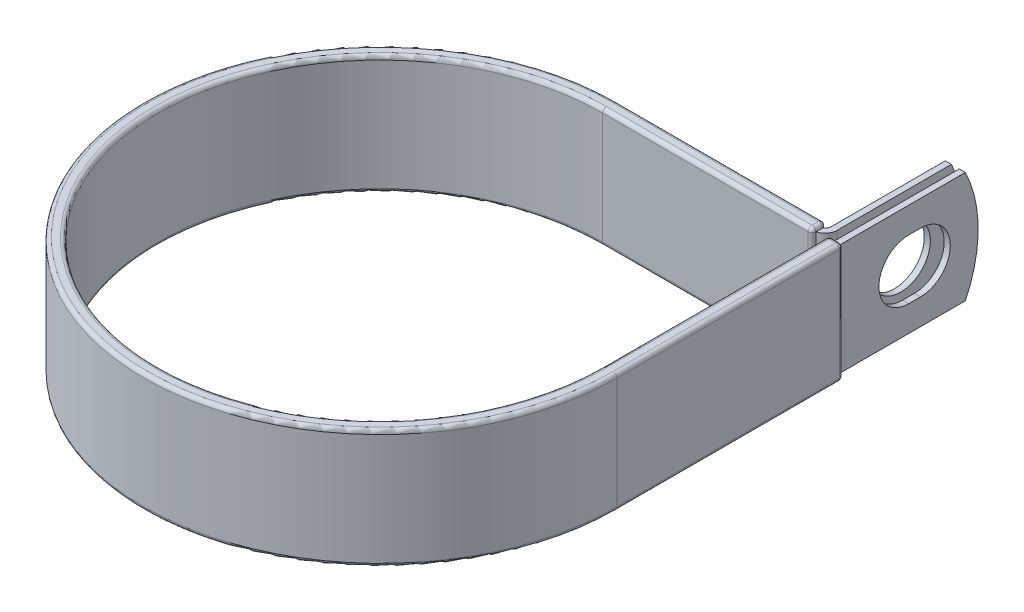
ISO-10303-21;
HEADER;
FILE_DESCRIPTION(('STEP AP214'),'2;1');
FILE_NAME('part.step','',(''),(''),'','','');
FILE_SCHEMA(('AUTOMOTIVE_DESIGN { 1 0 10303 214 1 1 1 1 }'));
ENDSEC;
DATA;
#1=APPLICATION_CONTEXT('core data for automotive mechanical design processes');
#2=APPLICATION_PROTOCOL_DEFINITION('international standard','automotive_design',2000,#1);
#3=PRODUCT_CONTEXT('',#1,'mechanical');
#4=PRODUCT('Part','Part','',(#3));
#5=PRODUCT_RELATED_PRODUCT_CATEGORY('part','',(#4));
#6=PRODUCT_DEFINITION_FORMATION('','',#4);
#7=PRODUCT_DEFINITION_CONTEXT('part definition',#1,'design');
#8=PRODUCT_DEFINITION('design','',#6,#7);
#9=PRODUCT_DEFINITION_SHAPE('','',#8);
#10=(LENGTH_UNIT() NAMED_UNIT(*) SI_UNIT(.MILLI.,.METRE.));
#11=(NAMED_UNIT(*) PLANE_ANGLE_UNIT() SI_UNIT($,.RADIAN.));
#12=(NAMED_UNIT(*) SI_UNIT($,.STERADIAN.) SOLID_ANGLE_UNIT());
#13=UNCERTAINTY_MEASURE_WITH_UNIT(LENGTH_MEASURE(1.E-05),#10,'distance_accuracy_value','');
#14=(GEOMETRIC_REPRESENTATION_CONTEXT(3) GLOBAL_UNCERTAINTY_ASSIGNED_CONTEXT((#13)) GLOBAL_UNIT_ASSIGNED_CONTEXT((#10,
#11,#12)) REPRESENTATION_CONTEXT('',''));
#15=CARTESIAN_POINT('',(0.,0.,0.));
#16=DIRECTION('',(0.,0.,1.));
#17=DIRECTION('',(1.,0.,0.));
#18=AXIS2_PLACEMENT_3D('',#15,#16,#17);
#19=CARTESIAN_POINT('',(43.66895,11.1125,-73.025));
#20=DIRECTION('',(1.,0.,0.));
#21=DIRECTION('',(0.,0.,-1.));
#22=AXIS2_PLACEMENT_3D('',#19,#20,#21);
#23=PLANE('',#22);
#24=CARTESIAN_POINT('',(43.66895,0.,-60.325));
#25=DIRECTION('',(1.,0.,0.));
#26=DIRECTION('',(0.,0.,-1.));
#27=AXIS2_PLACEMENT_3D('',#24,#25,#26);
#28=CIRCLE('',#27,5.9436);
#29=CARTESIAN_POINT('',(43.66895,0.,-66.2686));
#30=VERTEX_POINT('',#29);
#31=EDGE_CURVE('E460',#30,#30,#28,.F.);
#32=ORIENTED_EDGE('',*,*,#31,.T.);
#33=EDGE_LOOP('',(#32));
#34=FACE_BOUND('',#33,.T.);
#35=DIRECTION('',(0.,0.,1.));
#36=VECTOR('',#35,1.);
#37=CARTESIAN_POINT('',(43.66895,-11.1125,-73.025));
#38=LINE('',#37,#36);
#39=CARTESIAN_POINT('',(43.66895,-11.1125,-70.4651476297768));
#40=VERTEX_POINT('',#39);
#41=CARTESIAN_POINT('',(43.66895,-11.1125,-47.62119));
#42=VERTEX_POINT('',#41);
#43=EDGE_CURVE('E482',#40,#42,#38,.T.);
#44=ORIENTED_EDGE('',*,*,#43,.F.);
#45=CARTESIAN_POINT('',(43.66895,0.,-47.625));
#46=DIRECTION('',(1.,0.,0.));
#47=DIRECTION('',(0.,0.,-1.));
#48=AXIS2_PLACEMENT_3D('',#45,#46,#47);
#49=CIRCLE('',#48,25.4);
#50=CARTESIAN_POINT('',(43.66895,11.1125,-70.4651476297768));
#51=VERTEX_POINT('',#50);
#52=EDGE_CURVE('E419',#40,#51,#49,.T.);
#53=ORIENTED_EDGE('',*,*,#52,.T.);
#54=DIRECTION('',(0.,0.,1.));
#55=VECTOR('',#54,1.);
#56=CARTESIAN_POINT('',(43.66895,11.1125,-73.025));
#57=LINE('',#56,#55);
#58=CARTESIAN_POINT('',(43.66895,11.1125,-47.62119));
#59=VERTEX_POINT('',#58);
#60=EDGE_CURVE('E472',#51,#59,#57,.T.);
#61=ORIENTED_EDGE('',*,*,#60,.T.);
#62=DIRECTION('',(0.,-1.,0.));
#63=VECTOR('',#62,1.);
#64=CARTESIAN_POINT('',(43.66895,11.1125,-47.62119));
#65=LINE('',#64,#63);
#66=EDGE_CURVE('E489',#59,#42,#65,.T.);
#67=ORIENTED_EDGE('',*,*,#66,.T.);
#68=EDGE_LOOP('',(#44,#53,#61,#67));
#69=FACE_BOUND('',#68,.T.);
#70=ADVANCED_FACE('F54',(#34,#69),#23,.T.);
#71=CARTESIAN_POINT('',(42.44975,11.1125,-73.025));
#72=DIRECTION('',(1.,0.,0.));
#73=DIRECTION('',(0.,0.,-1.));
#74=AXIS2_PLACEMENT_3D('',#71,#72,#73);
#75=PLANE('',#74);
#76=CARTESIAN_POINT('',(42.44975,0.,-60.325));
#77=DIRECTION('',(-1.,0.,0.));
#78=DIRECTION('',(0.,0.,1.));
#79=AXIS2_PLACEMENT_3D('',#76,#77,#78);
#80=CIRCLE('',#79,5.9436);
#81=CARTESIAN_POINT('',(42.44975,0.,-54.3814));
#82=VERTEX_POINT('',#81);
#83=EDGE_CURVE('E457',#82,#82,#80,.T.);
#84=ORIENTED_EDGE('',*,*,#83,.F.);
#85=EDGE_LOOP('',(#84));
#86=FACE_BOUND('',#85,.T.);
#87=CARTESIAN_POINT('',(42.44975,0.,-47.625));
#88=DIRECTION('',(-1.,0.,0.));
#89=DIRECTION('',(0.,0.,1.));
#90=AXIS2_PLACEMENT_3D('',#87,#88,#89);
#91=CIRCLE('',#90,25.4);
#92=CARTESIAN_POINT('',(42.44975,11.1125,-70.4651476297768));
#93=VERTEX_POINT('',#92);
#94=CARTESIAN_POINT('',(42.44975,-11.1125,-70.4651476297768));
#95=VERTEX_POINT('',#94);
#96=EDGE_CURVE('E411',#93,#95,#91,.T.);
#97=ORIENTED_EDGE('',*,*,#96,.T.);
#98=DIRECTION('',(0.,0.,1.));
#99=VECTOR('',#98,1.);
#100=CARTESIAN_POINT('',(42.44975,-11.1125,-73.025));
#101=LINE('',#100,#99);
#102=CARTESIAN_POINT('',(42.44975,-11.1125,-47.62119));
#103=VERTEX_POINT('',#102);
#104=EDGE_CURVE('E484',#95,#103,#101,.T.);
#105=ORIENTED_EDGE('',*,*,#104,.T.);
#106=DIRECTION('',(0.,-1.,0.));
#107=VECTOR('',#106,1.);
#108=CARTESIAN_POINT('',(42.44975,11.1125,-47.62119));
#109=LINE('',#108,#107);
#110=CARTESIAN_POINT('',(42.44975,11.1125,-47.62119));
#111=VERTEX_POINT('',#110);
#112=EDGE_CURVE('E477',#111,#103,#109,.T.);
#113=ORIENTED_EDGE('',*,*,#112,.F.);
#114=DIRECTION('',(0.,0.,1.));
#115=VECTOR('',#114,1.);
#116=CARTESIAN_POINT('',(42.44975,11.1125,-73.025));
#117=LINE('',#116,#115);
#118=EDGE_CURVE('E474',#93,#111,#117,.T.);
#119=ORIENTED_EDGE('',*,*,#118,.F.);
#120=EDGE_LOOP('',(#97,#105,#113,#119));
#121=FACE_BOUND('',#120,.T.);
#122=ADVANCED_FACE('F788',(#86,#121),#75,.F.);
#123=CARTESIAN_POINT('',(0.,-11.1125,0.));
#124=DIRECTION('',(0.,1.,0.));
#125=DIRECTION('',(1.,0.,0.));
#126=AXIS2_PLACEMENT_3D('',#123,#124,#125);
#127=PLANE('',#126);
#128=CARTESIAN_POINT('',(41.29151,-11.1125,-47.62119));
#129=DIRECTION('',(0.,-1.,0.));
#130=DIRECTION('',(0.,0.,1.));
#131=AXIS2_PLACEMENT_3D('',#128,#129,#130);
#132=CIRCLE('',#131,2.37744);
#133=CARTESIAN_POINT('',(41.8147500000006,-11.1125,-45.3020434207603));
#134=VERTEX_POINT('',#133);
#135=EDGE_CURVE('E479',#42,#134,#132,.T.);
#136=ORIENTED_EDGE('',*,*,#135,.T.);
#137=DIRECTION('',(0.,0.,-1.));
#138=VECTOR('',#137,1.);
#139=CARTESIAN_POINT('',(41.8147500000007,-11.1125,-46.46295));
#140=LINE('',#139,#138);
#141=CARTESIAN_POINT('',(41.8147500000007,-11.1125,-46.4947));
#142=VERTEX_POINT('',#141);
#143=EDGE_CURVE('E368',#134,#142,#140,.T.);
#144=ORIENTED_EDGE('',*,*,#143,.T.);
#145=CARTESIAN_POINT('',(41.0527500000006,-11.1125,-46.4947));
#146=DIRECTION('',(0.,1.,0.));
#147=DIRECTION('',(0.,0.,1.));
#148=AXIS2_PLACEMENT_3D('',#145,#146,#147);
#149=CIRCLE('',#148,0.762);
#150=CARTESIAN_POINT('',(41.8093610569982,-11.1125,-46.5851638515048));
#151=VERTEX_POINT('',#150);
#152=EDGE_CURVE('E554',#142,#151,#149,.T.);
#153=ORIENTED_EDGE('',*,*,#152,.T.);
#154=CARTESIAN_POINT('',(41.29151,-11.1125,-47.62119));
#155=DIRECTION('',(0.,1.,0.));
#156=DIRECTION('',(1.,0.,0.));
#157=AXIS2_PLACEMENT_3D('',#154,#155,#156);
#158=CIRCLE('',#157,1.15824000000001);
#159=EDGE_CURVE('E77',#103,#151,#158,.F.);
#160=ORIENTED_EDGE('',*,*,#159,.F.);
#161=ORIENTED_EDGE('',*,*,#104,.F.);
#162=DIRECTION('',(-1.,0.,0.));
#163=VECTOR('',#162,1.);
#164=CARTESIAN_POINT('',(46.46295,-11.1125,-70.4651476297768));
#165=LINE('',#164,#163);
#166=EDGE_CURVE('E498',#40,#95,#165,.T.);
#167=ORIENTED_EDGE('',*,*,#166,.F.);
#168=ORIENTED_EDGE('',*,*,#43,.T.);
#169=EDGE_LOOP('',(#136,#144,#153,#160,#161,#167,#168));
#170=FACE_BOUND('',#169,.T.);
#171=ADVANCED_FACE('F794',(#170),#127,.F.);
#172=CARTESIAN_POINT('',(0.,11.1125,0.));
#173=DIRECTION('',(0.,1.,0.));
#174=DIRECTION('',(1.,0.,0.));
#175=AXIS2_PLACEMENT_3D('',#172,#173,#174);
#176=PLANE('',#175);
#177=DIRECTION('',(0.,0.,-1.));
#178=VECTOR('',#177,1.);
#179=CARTESIAN_POINT('',(41.81475,11.1125,5.86542092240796E-13));
#180=LINE('',#179,#178);
#181=CARTESIAN_POINT('',(41.8147500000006,11.1125,-45.3020434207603));
#182=VERTEX_POINT('',#181);
#183=CARTESIAN_POINT('',(41.8147500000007,11.1125,-46.4947));
#184=VERTEX_POINT('',#183);
#185=EDGE_CURVE('E405',#182,#184,#180,.T.);
#186=ORIENTED_EDGE('',*,*,#185,.F.);
#187=CARTESIAN_POINT('',(41.29151,11.1125,-47.62119));
#188=DIRECTION('',(0.,-1.,0.));
#189=DIRECTION('',(0.,0.,1.));
#190=AXIS2_PLACEMENT_3D('',#187,#188,#189);
#191=CIRCLE('',#190,2.37744);
#192=EDGE_CURVE('E469',#59,#182,#191,.T.);
#193=ORIENTED_EDGE('',*,*,#192,.F.);
#194=ORIENTED_EDGE('',*,*,#60,.F.);
#195=DIRECTION('',(-1.,0.,0.));
#196=VECTOR('',#195,1.);
#197=CARTESIAN_POINT('',(46.46295,11.1125,-70.4651476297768));
#198=LINE('',#197,#196);
#199=EDGE_CURVE('E495',#51,#93,#198,.T.);
#200=ORIENTED_EDGE('',*,*,#199,.T.);
#201=ORIENTED_EDGE('',*,*,#118,.T.);
#202=CARTESIAN_POINT('',(41.29151,11.1125,-47.62119));
#203=DIRECTION('',(0.,1.,0.));
#204=DIRECTION('',(1.,0.,0.));
#205=AXIS2_PLACEMENT_3D('',#202,#203,#204);
#206=CIRCLE('',#205,1.15824000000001);
#207=CARTESIAN_POINT('',(41.8093610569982,11.1125,-46.5851638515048));
#208=VERTEX_POINT('',#207);
#209=EDGE_CURVE('E70',#111,#208,#206,.F.);
#210=ORIENTED_EDGE('',*,*,#209,.T.);
#211=CARTESIAN_POINT('',(41.0527500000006,11.1125,-46.4947));
#212=DIRECTION('',(0.,1.,0.));
#213=DIRECTION('',(0.,0.,1.));
#214=AXIS2_PLACEMENT_3D('',#211,#212,#213);
#215=CIRCLE('',#214,0.762);
#216=EDGE_CURVE('E12',#208,#184,#215,.F.);
#217=ORIENTED_EDGE('',*,*,#216,.T.);
#218=EDGE_LOOP('',(#186,#193,#194,#200,#201,#210,#217));
#219=FACE_BOUND('',#218,.T.);
#220=ADVANCED_FACE('F802',(#219),#176,.T.);
#221=CARTESIAN_POINT('',(41.29151,11.1125,-47.62119));
#222=DIRECTION('',(0.,-1.,0.));
#223=DIRECTION('',(0.,0.,-1.));
#224=AXIS2_PLACEMENT_3D('',#221,#222,#223);
#225=CYLINDRICAL_SURFACE('',#224,2.37744);
#226=ORIENTED_EDGE('',*,*,#135,.F.);
#227=ORIENTED_EDGE('',*,*,#66,.F.);
#228=ORIENTED_EDGE('',*,*,#192,.T.);
#229=CARTESIAN_POINT('',(41.29151,11.1125,-47.62119));
#230=DIRECTION('',(0.,-1.,0.));
#231=DIRECTION('',(0.,0.,-1.));
#232=AXIS2_PLACEMENT_3D('',#229,#230,#231);
#233=CIRCLE('',#232,2.37744);
#234=CARTESIAN_POINT('',(41.29151,11.1125,-45.24375));
#235=VERTEX_POINT('',#234);
#236=EDGE_CURVE('E402',#235,#182,#233,.F.);
#237=ORIENTED_EDGE('',*,*,#236,.F.);
#238=DIRECTION('',(0.,-1.,0.));
#239=VECTOR('',#238,1.);
#240=CARTESIAN_POINT('',(41.29151,11.1125,-45.24375));
#241=LINE('',#240,#239);
#242=CARTESIAN_POINT('',(41.29151,-11.1125,-45.24375));
#243=VERTEX_POINT('',#242);
#244=EDGE_CURVE('E492',#235,#243,#241,.T.);
#245=ORIENTED_EDGE('',*,*,#244,.T.);
#246=CARTESIAN_POINT('',(41.29151,-11.1125,-47.62119));
#247=DIRECTION('',(0.,1.,0.));
#248=DIRECTION('',(0.,0.,1.));
#249=AXIS2_PLACEMENT_3D('',#246,#247,#248);
#250=CIRCLE('',#249,2.37744);
#251=EDGE_CURVE('E400',#134,#243,#250,.F.);
#252=ORIENTED_EDGE('',*,*,#251,.F.);
#253=EDGE_LOOP('',(#226,#227,#228,#237,#245,#252));
#254=FACE_BOUND('',#253,.T.);
#255=ADVANCED_FACE('F799',(#254),#225,.T.);
#256=CARTESIAN_POINT('',(41.29151,11.1125,-47.62119));
#257=DIRECTION('',(0.,-1.,0.));
#258=DIRECTION('',(0.,0.,-1.));
#259=AXIS2_PLACEMENT_3D('',#256,#257,#258);
#260=CYLINDRICAL_SURFACE('',#259,1.15824000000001);
#261=ORIENTED_EDGE('',*,*,#159,.T.);
#262=DIRECTION('',(0.,1.,0.));
#263=VECTOR('',#262,1.);
#264=CARTESIAN_POINT('',(41.8093610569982,-11.1125,-46.5851638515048));
#265=LINE('',#264,#263);
#266=EDGE_CURVE('E63',#151,#208,#265,.T.);
#267=ORIENTED_EDGE('',*,*,#266,.T.);
#268=ORIENTED_EDGE('',*,*,#209,.F.);
#269=ORIENTED_EDGE('',*,*,#112,.T.);
#270=EDGE_LOOP('',(#261,#267,#268,#269));
#271=FACE_BOUND('',#270,.T.);
#272=ADVANCED_FACE('F801',(#271),#260,.F.);
#273=CARTESIAN_POINT('',(60.4799894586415,0.,-60.325));
#274=DIRECTION('',(-1.,0.,0.));
#275=DIRECTION('',(0.,0.,1.));
#276=AXIS2_PLACEMENT_3D('',#273,#274,#275);
#277=CYLINDRICAL_SURFACE('',#276,5.9436);
#278=ORIENTED_EDGE('',*,*,#83,.T.);
#279=EDGE_LOOP('',(#278));
#280=FACE_BOUND('',#279,.T.);
#281=ORIENTED_EDGE('',*,*,#31,.F.);
#282=EDGE_LOOP('',(#281));
#283=FACE_BOUND('',#282,.T.);
#284=ADVANCED_FACE('F808',(#280,#283),#277,.F.);
#285=CARTESIAN_POINT('',(46.46295,0.,-47.625));
#286=DIRECTION('',(-1.,0.,0.));
#287=DIRECTION('',(0.,0.,1.));
#288=AXIS2_PLACEMENT_3D('',#285,#286,#287);
#289=CYLINDRICAL_SURFACE('',#288,25.4);
#290=ORIENTED_EDGE('',*,*,#52,.F.);
#291=ORIENTED_EDGE('',*,*,#166,.T.);
#292=ORIENTED_EDGE('',*,*,#96,.F.);
#293=ORIENTED_EDGE('',*,*,#199,.F.);
#294=EDGE_LOOP('',(#290,#291,#292,#293));
#295=FACE_BOUND('',#294,.T.);
#296=ADVANCED_FACE('F859',(#295),#289,.T.);
#297=CARTESIAN_POINT('',(6.34641215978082E-13,-11.1125,-45.24375));
#298=DIRECTION('',(0.,0.,1.));
#299=DIRECTION('',(1.,0.,0.));
#300=AXIS2_PLACEMENT_3D('',#297,#298,#299);
#301=PLANE('',#300);
#302=DIRECTION('',(1.,0.,0.));
#303=VECTOR('',#302,1.);
#304=CARTESIAN_POINT('',(6.34641215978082E-13,-11.1125,-45.24375));
#305=LINE('',#304,#303);
#306=CARTESIAN_POINT('',(41.8147500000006,-11.1125,-45.24375));
#307=VERTEX_POINT('',#306);
#308=EDGE_CURVE('E375',#243,#307,#305,.T.);
#309=ORIENTED_EDGE('',*,*,#308,.F.);
#310=ORIENTED_EDGE('',*,*,#244,.F.);
#311=DIRECTION('',(1.,0.,0.));
#312=VECTOR('',#311,1.);
#313=CARTESIAN_POINT('',(6.34641215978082E-13,11.1125,-45.24375));
#314=LINE('',#313,#312);
#315=CARTESIAN_POINT('',(41.8147500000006,11.1125,-45.24375));
#316=VERTEX_POINT('',#315);
#317=EDGE_CURVE('E377',#235,#316,#314,.T.);
#318=ORIENTED_EDGE('',*,*,#317,.T.);
#319=DIRECTION('',(0.,-1.,0.));
#320=VECTOR('',#319,1.);
#321=CARTESIAN_POINT('',(41.8147500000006,-11.1125,-45.24375));
#322=LINE('',#321,#320);
#323=EDGE_CURVE('E307',#316,#307,#322,.T.);
#324=ORIENTED_EDGE('',*,*,#323,.T.);
#325=EDGE_LOOP('',(#309,#310,#318,#324));
#326=FACE_BOUND('',#325,.T.);
#327=ADVANCED_FACE('F831',(#326),#301,.F.);
#328=CARTESIAN_POINT('',(41.8147500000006,-11.14425,-45.212));
#329=DIRECTION('',(1.,0.,0.));
#330=DIRECTION('',(0.,0.,-1.));
#331=AXIS2_PLACEMENT_3D('',#328,#329,#330);
#332=PLANE('',#331);
#333=DIRECTION('',(0.,0.,-1.));
#334=VECTOR('',#333,1.);
#335=CARTESIAN_POINT('',(41.8147500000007,-11.14425,-46.4947));
#336=LINE('',#335,#334);
#337=CARTESIAN_POINT('',(41.8147500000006,-11.14425,-45.212));
#338=VERTEX_POINT('',#337);
#339=CARTESIAN_POINT('',(41.8147500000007,-11.14425,-46.4947));
#340=VERTEX_POINT('',#339);
#341=EDGE_CURVE('E508',#338,#340,#336,.T.);
#342=ORIENTED_EDGE('',*,*,#341,.T.);
#343=DIRECTION('',(0.,1.,0.));
#344=VECTOR('',#343,1.);
#345=CARTESIAN_POINT('',(41.8147500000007,-11.14425,-46.4947));
#346=LINE('',#345,#344);
#347=EDGE_CURVE('E512',#340,#142,#346,.T.);
#348=ORIENTED_EDGE('',*,*,#347,.T.);
#349=ORIENTED_EDGE('',*,*,#143,.F.);
#350=EDGE_CURVE('E369',#307,#134,#140,.T.);
#351=ORIENTED_EDGE('',*,*,#350,.F.);
#352=ORIENTED_EDGE('',*,*,#323,.F.);
#353=DIRECTION('',(0.,0.,1.));
#354=VECTOR('',#353,1.);
#355=CARTESIAN_POINT('',(41.8147500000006,11.1125,-45.24375));
#356=LINE('',#355,#354);
#357=EDGE_CURVE('E372',#182,#316,#356,.T.);
#358=ORIENTED_EDGE('',*,*,#357,.F.);
#359=ORIENTED_EDGE('',*,*,#185,.T.);
#360=DIRECTION('',(0.,1.,0.));
#361=VECTOR('',#360,1.);
#362=CARTESIAN_POINT('',(41.8147500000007,-11.14425,-46.4947));
#363=LINE('',#362,#361);
#364=CARTESIAN_POINT('',(41.8147500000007,11.14425,-46.4947));
#365=VERTEX_POINT('',#364);
#366=EDGE_CURVE('E510',#184,#365,#363,.T.);
#367=ORIENTED_EDGE('',*,*,#366,.T.);
#368=DIRECTION('',(0.,0.,1.));
#369=VECTOR('',#368,1.);
#370=CARTESIAN_POINT('',(41.8147500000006,11.14425,-45.212));
#371=LINE('',#370,#369);
#372=CARTESIAN_POINT('',(41.8147500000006,11.14425,-45.212));
#373=VERTEX_POINT('',#372);
#374=EDGE_CURVE('E504',#365,#373,#371,.T.);
#375=ORIENTED_EDGE('',*,*,#374,.T.);
#376=DIRECTION('',(0.,-1.,0.));
#377=VECTOR('',#376,1.);
#378=CARTESIAN_POINT('',(41.8147500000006,-11.14425,-45.212));
#379=LINE('',#378,#377);
#380=EDGE_CURVE('E506',#373,#338,#379,.T.);
#381=ORIENTED_EDGE('',*,*,#380,.T.);
#382=EDGE_LOOP('',(#342,#348,#349,#351,#352,#358,#359,#367,#375,#381));
#383=FACE_BOUND('',#382,.T.);
#384=ADVANCED_FACE('F827',(#383),#332,.T.);
#385=CARTESIAN_POINT('',(6.52188488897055E-13,-11.14425,-46.4947));
#386=DIRECTION('',(1.,0.,0.));
#387=DIRECTION('',(0.,0.,-1.));
#388=AXIS2_PLACEMENT_3D('',#385,#386,#387);
#389=CYLINDRICAL_SURFACE('',#388,0.762000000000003);
#390=DIRECTION('',(1.,0.,0.));
#391=VECTOR('',#390,1.);
#392=CARTESIAN_POINT('',(6.62877183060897E-13,-11.14425,-47.2567));
#393=LINE('',#392,#391);
#394=CARTESIAN_POINT('',(6.62877183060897E-13,-11.14425,-47.2567));
#395=VERTEX_POINT('',#394);
#396=CARTESIAN_POINT('',(41.0527500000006,-11.14425,-47.2567));
#397=VERTEX_POINT('',#396);
#398=EDGE_CURVE('E394',#395,#397,#393,.T.);
#399=ORIENTED_EDGE('',*,*,#398,.T.);
#400=CARTESIAN_POINT('',(41.0527500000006,-11.14425,-46.4947));
#401=DIRECTION('',(1.,0.,0.));
#402=DIRECTION('',(0.,0.,-1.));
#403=AXIS2_PLACEMENT_3D('',#400,#401,#402);
#404=CIRCLE('',#403,0.762000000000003);
#405=CARTESIAN_POINT('',(41.0527500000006,-11.90625,-46.4947));
#406=VERTEX_POINT('',#405);
#407=EDGE_CURVE('E517',#397,#406,#404,.F.);
#408=ORIENTED_EDGE('',*,*,#407,.T.);
#409=DIRECTION('',(1.,0.,0.));
#410=VECTOR('',#409,1.);
#411=CARTESIAN_POINT('',(6.52188488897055E-13,-11.90625,-46.4947));
#412=LINE('',#411,#410);
#413=CARTESIAN_POINT('',(6.52188488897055E-13,-11.90625,-46.4947));
#414=VERTEX_POINT('',#413);
#415=EDGE_CURVE('E397',#414,#406,#412,.T.);
#416=ORIENTED_EDGE('',*,*,#415,.F.);
#417=CARTESIAN_POINT('',(6.52188488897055E-13,-11.14425,-46.4947));
#418=DIRECTION('',(1.,0.,0.));
#419=DIRECTION('',(0.,0.,1.));
#420=AXIS2_PLACEMENT_3D('',#417,#418,#419);
#421=CIRCLE('',#420,0.762000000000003);
#422=EDGE_CURVE('E345',#414,#395,#421,.T.);
#423=ORIENTED_EDGE('',*,*,#422,.T.);
#424=EDGE_LOOP('',(#399,#408,#416,#423));
#425=FACE_BOUND('',#424,.T.);
#426=ADVANCED_FACE('F670',(#425),#389,.T.);
#427=CARTESIAN_POINT('',(6.62877183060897E-13,11.14425,-47.2567));
#428=DIRECTION('',(0.,0.,-1.));
#429=DIRECTION('',(0.,1.,0.));
#430=AXIS2_PLACEMENT_3D('',#427,#428,#429);
#431=PLANE('',#430);
#432=DIRECTION('',(1.,0.,0.));
#433=VECTOR('',#432,1.);
#434=CARTESIAN_POINT('',(6.62877183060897E-13,11.14425,-47.2567));
#435=LINE('',#434,#433);
#436=CARTESIAN_POINT('',(6.62877183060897E-13,11.14425,-47.2567));
#437=VERTEX_POINT('',#436);
#438=CARTESIAN_POINT('',(41.0527500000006,11.14425,-47.2567));
#439=VERTEX_POINT('',#438);
#440=EDGE_CURVE('E391',#437,#439,#435,.T.);
#441=ORIENTED_EDGE('',*,*,#440,.T.);
#442=DIRECTION('',(0.,1.,0.));
#443=VECTOR('',#442,1.);
#444=CARTESIAN_POINT('',(41.0527500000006,11.14425,-47.2567));
#445=LINE('',#444,#443);
#446=EDGE_CURVE('E515',#439,#397,#445,.F.);
#447=ORIENTED_EDGE('',*,*,#446,.T.);
#448=ORIENTED_EDGE('',*,*,#398,.F.);
#449=DIRECTION('',(0.,1.,0.));
#450=VECTOR('',#449,1.);
#451=CARTESIAN_POINT('',(6.62877183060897E-13,11.14425,-47.2567));
#452=LINE('',#451,#450);
#453=EDGE_CURVE('E342',#395,#437,#452,.T.);
#454=ORIENTED_EDGE('',*,*,#453,.T.);
#455=EDGE_LOOP('',(#441,#447,#448,#454));
#456=FACE_BOUND('',#455,.T.);
#457=ADVANCED_FACE('F676',(#456),#431,.T.);
#458=CARTESIAN_POINT('',(6.52188488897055E-13,11.14425,-46.4947));
#459=DIRECTION('',(1.,0.,0.));
#460=DIRECTION('',(0.,0.,-1.));
#461=AXIS2_PLACEMENT_3D('',#458,#459,#460);
#462=CYLINDRICAL_SURFACE('',#461,0.762);
#463=DIRECTION('',(1.,0.,0.));
#464=VECTOR('',#463,1.);
#465=CARTESIAN_POINT('',(6.52188488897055E-13,11.90625,-46.4947));
#466=LINE('',#465,#464);
#467=CARTESIAN_POINT('',(6.52188488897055E-13,11.90625,-46.4947));
#468=VERTEX_POINT('',#467);
#469=CARTESIAN_POINT('',(41.0527500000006,11.90625,-46.4947));
#470=VERTEX_POINT('',#469);
#471=EDGE_CURVE('E388',#468,#470,#466,.T.);
#472=ORIENTED_EDGE('',*,*,#471,.T.);
#473=CARTESIAN_POINT('',(41.0527500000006,11.14425,-46.4947));
#474=DIRECTION('',(1.,0.,0.));
#475=DIRECTION('',(0.,0.,-1.));
#476=AXIS2_PLACEMENT_3D('',#473,#474,#475);
#477=CIRCLE('',#476,0.762);
#478=EDGE_CURVE('E501',#470,#439,#477,.F.);
#479=ORIENTED_EDGE('',*,*,#478,.T.);
#480=ORIENTED_EDGE('',*,*,#440,.F.);
#481=CARTESIAN_POINT('',(6.52188488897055E-13,11.14425,-46.4947));
#482=DIRECTION('',(1.,0.,0.));
#483=DIRECTION('',(0.,0.,1.));
#484=AXIS2_PLACEMENT_3D('',#481,#482,#483);
#485=CIRCLE('',#484,0.762);
#486=EDGE_CURVE('E339',#437,#468,#485,.T.);
#487=ORIENTED_EDGE('',*,*,#486,.T.);
#488=EDGE_LOOP('',(#472,#479,#480,#487));
#489=FACE_BOUND('',#488,.T.);
#490=ADVANCED_FACE('F680',(#489),#462,.T.);
#491=CARTESIAN_POINT('',(6.34195853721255E-13,11.14425,-45.212));
#492=DIRECTION('',(1.,0.,0.));
#493=DIRECTION('',(0.,0.,-1.));
#494=AXIS2_PLACEMENT_3D('',#491,#492,#493);
#495=CYLINDRICAL_SURFACE('',#494,0.761999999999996);
#496=DIRECTION('',(1.,0.,0.));
#497=VECTOR('',#496,1.);
#498=CARTESIAN_POINT('',(6.23507159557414E-13,11.14425,-44.45));
#499=LINE('',#498,#497);
#500=CARTESIAN_POINT('',(6.23507159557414E-13,11.14425,-44.45));
#501=VERTEX_POINT('',#500);
#502=CARTESIAN_POINT('',(41.0527500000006,11.14425,-44.45));
#503=VERTEX_POINT('',#502);
#504=EDGE_CURVE('E382',#501,#503,#499,.T.);
#505=ORIENTED_EDGE('',*,*,#504,.T.);
#506=CARTESIAN_POINT('',(41.0527500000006,11.14425,-45.212));
#507=DIRECTION('',(1.,0.,0.));
#508=DIRECTION('',(0.,0.,-1.));
#509=AXIS2_PLACEMENT_3D('',#506,#507,#508);
#510=CIRCLE('',#509,0.761999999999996);
#511=CARTESIAN_POINT('',(41.0527500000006,11.90625,-45.212));
#512=VERTEX_POINT('',#511);
#513=EDGE_CURVE('E527',#503,#512,#510,.F.);
#514=ORIENTED_EDGE('',*,*,#513,.T.);
#515=DIRECTION('',(1.,0.,0.));
#516=VECTOR('',#515,1.);
#517=CARTESIAN_POINT('',(6.34195853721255E-13,11.90625,-45.212));
#518=LINE('',#517,#516);
#519=CARTESIAN_POINT('',(6.34195853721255E-13,11.90625,-45.212));
#520=VERTEX_POINT('',#519);
#521=EDGE_CURVE('E385',#520,#512,#518,.T.);
#522=ORIENTED_EDGE('',*,*,#521,.F.);
#523=CARTESIAN_POINT('',(6.34195853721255E-13,11.14425,-45.212));
#524=DIRECTION('',(1.,0.,0.));
#525=DIRECTION('',(0.,0.,1.));
#526=AXIS2_PLACEMENT_3D('',#523,#524,#525);
#527=CIRCLE('',#526,0.761999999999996);
#528=EDGE_CURVE('E336',#520,#501,#527,.T.);
#529=ORIENTED_EDGE('',*,*,#528,.T.);
#530=EDGE_LOOP('',(#505,#514,#522,#529));
#531=FACE_BOUND('',#530,.T.);
#532=ADVANCED_FACE('F721',(#531),#495,.T.);
#533=CARTESIAN_POINT('',(6.23507159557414E-13,-11.14425,-44.45));
#534=DIRECTION('',(0.,0.,1.));
#535=DIRECTION('',(0.,-1.,0.));
#536=AXIS2_PLACEMENT_3D('',#533,#534,#535);
#537=PLANE('',#536);
#538=DIRECTION('',(1.,0.,0.));
#539=VECTOR('',#538,1.);
#540=CARTESIAN_POINT('',(6.23507159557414E-13,-11.14425,-44.45));
#541=LINE('',#540,#539);
#542=CARTESIAN_POINT('',(6.23507159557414E-13,-11.14425,-44.45));
#543=VERTEX_POINT('',#542);
#544=CARTESIAN_POINT('',(41.0527500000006,-11.14425,-44.45));
#545=VERTEX_POINT('',#544);
#546=EDGE_CURVE('E379',#543,#545,#541,.T.);
#547=ORIENTED_EDGE('',*,*,#546,.T.);
#548=DIRECTION('',(0.,-1.,0.));
#549=VECTOR('',#548,1.);
#550=CARTESIAN_POINT('',(41.0527500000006,-11.14425,-44.45));
#551=LINE('',#550,#549);
#552=EDGE_CURVE('E525',#545,#503,#551,.F.);
#553=ORIENTED_EDGE('',*,*,#552,.T.);
#554=ORIENTED_EDGE('',*,*,#504,.F.);
#555=DIRECTION('',(0.,-1.,0.));
#556=VECTOR('',#555,1.);
#557=CARTESIAN_POINT('',(6.23507159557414E-13,-11.14425,-44.45));
#558=LINE('',#557,#556);
#559=EDGE_CURVE('E327',#501,#543,#558,.T.);
#560=ORIENTED_EDGE('',*,*,#559,.T.);
#561=EDGE_LOOP('',(#547,#553,#554,#560));
#562=FACE_BOUND('',#561,.T.);
#563=ADVANCED_FACE('F719',(#562),#537,.T.);
#564=CARTESIAN_POINT('',(6.34195853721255E-13,-11.14425,-45.212));
#565=DIRECTION('',(1.,0.,0.));
#566=DIRECTION('',(0.,0.,-1.));
#567=AXIS2_PLACEMENT_3D('',#564,#565,#566);
#568=CYLINDRICAL_SURFACE('',#567,0.762000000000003);
#569=DIRECTION('',(1.,0.,0.));
#570=VECTOR('',#569,1.);
#571=CARTESIAN_POINT('',(6.34195853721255E-13,-11.90625,-45.212));
#572=LINE('',#571,#570);
#573=CARTESIAN_POINT('',(6.34195853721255E-13,-11.90625,-45.212));
#574=VERTEX_POINT('',#573);
#575=CARTESIAN_POINT('',(41.0527500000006,-11.90625,-45.212));
#576=VERTEX_POINT('',#575);
#577=EDGE_CURVE('E303',#574,#576,#572,.T.);
#578=ORIENTED_EDGE('',*,*,#577,.T.);
#579=CARTESIAN_POINT('',(41.0527500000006,-11.14425,-45.212));
#580=DIRECTION('',(1.,0.,0.));
#581=DIRECTION('',(0.,0.,-1.));
#582=AXIS2_PLACEMENT_3D('',#579,#580,#581);
#583=CIRCLE('',#582,0.762000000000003);
#584=EDGE_CURVE('E523',#576,#545,#583,.F.);
#585=ORIENTED_EDGE('',*,*,#584,.T.);
#586=ORIENTED_EDGE('',*,*,#546,.F.);
#587=CARTESIAN_POINT('',(6.34195853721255E-13,-11.14425,-45.212));
#588=DIRECTION('',(1.,0.,0.));
#589=DIRECTION('',(0.,0.,-1.));
#590=AXIS2_PLACEMENT_3D('',#587,#588,#589);
#591=CIRCLE('',#590,0.762000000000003);
#592=EDGE_CURVE('E324',#543,#574,#591,.T.);
#593=ORIENTED_EDGE('',*,*,#592,.T.);
#594=EDGE_LOOP('',(#578,#585,#586,#593));
#595=FACE_BOUND('',#594,.T.);
#596=ADVANCED_FACE('F709',(#595),#568,.T.);
#597=CARTESIAN_POINT('',(0.,-11.14425,0.));
#598=DIRECTION('',(0.,-1.,0.));
#599=DIRECTION('',(0.,0.,-1.));
#600=AXIS2_PLACEMENT_3D('',#597,#598,#599);
#601=TOROIDAL_SURFACE('',#600,46.4947,0.762000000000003);
#602=CARTESIAN_POINT('',(46.4947,-11.14425,0.));
#603=DIRECTION('',(0.,0.,1.));
#604=DIRECTION('',(-1.,0.,0.));
#605=AXIS2_PLACEMENT_3D('',#602,#603,#604);
#606=CIRCLE('',#605,0.762000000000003);
#607=CARTESIAN_POINT('',(46.4947,-11.90625,0.));
#608=VERTEX_POINT('',#607);
#609=CARTESIAN_POINT('',(47.2567,-11.14425,0.));
#610=VERTEX_POINT('',#609);
#611=EDGE_CURVE('E318',#608,#610,#606,.T.);
#612=ORIENTED_EDGE('',*,*,#611,.T.);
#613=CARTESIAN_POINT('',(0.,-11.14425,0.));
#614=DIRECTION('',(0.,-1.,0.));
#615=DIRECTION('',(0.,0.,-1.));
#616=AXIS2_PLACEMENT_3D('',#613,#614,#615);
#617=CIRCLE('',#616,47.2567);
#618=EDGE_CURVE('E361',#610,#395,#617,.T.);
#619=ORIENTED_EDGE('',*,*,#618,.T.);
#620=ORIENTED_EDGE('',*,*,#422,.F.);
#621=CARTESIAN_POINT('',(0.,-11.90625,0.));
#622=DIRECTION('',(0.,-1.,0.));
#623=DIRECTION('',(0.,0.,-1.));
#624=AXIS2_PLACEMENT_3D('',#621,#622,#623);
#625=CIRCLE('',#624,46.4947);
#626=EDGE_CURVE('E308',#608,#414,#625,.T.);
#627=ORIENTED_EDGE('',*,*,#626,.F.);
#628=EDGE_LOOP('',(#612,#619,#620,#627));
#629=FACE_BOUND('',#628,.T.);
#630=ADVANCED_FACE('F667',(#629),#601,.T.);
#631=CARTESIAN_POINT('',(0.,11.1125,0.));
#632=DIRECTION('',(0.,-1.,0.));
#633=DIRECTION('',(0.,0.,-1.));
#634=AXIS2_PLACEMENT_3D('',#631,#632,#633);
#635=CYLINDRICAL_SURFACE('',#634,47.2567);
#636=DIRECTION('',(0.,1.,0.));
#637=VECTOR('',#636,1.);
#638=CARTESIAN_POINT('',(47.2567,11.14425,0.));
#639=LINE('',#638,#637);
#640=CARTESIAN_POINT('',(47.2567,11.14425,0.));
#641=VERTEX_POINT('',#640);
#642=EDGE_CURVE('E655',#610,#641,#639,.T.);
#643=ORIENTED_EDGE('',*,*,#642,.T.);
#644=CARTESIAN_POINT('',(0.,11.14425,0.));
#645=DIRECTION('',(0.,-1.,0.));
#646=DIRECTION('',(0.,0.,-1.));
#647=AXIS2_PLACEMENT_3D('',#644,#645,#646);
#648=CIRCLE('',#647,47.2567);
#649=EDGE_CURVE('E358',#641,#437,#648,.T.);
#650=ORIENTED_EDGE('',*,*,#649,.T.);
#651=ORIENTED_EDGE('',*,*,#453,.F.);
#652=ORIENTED_EDGE('',*,*,#618,.F.);
#653=EDGE_LOOP('',(#643,#650,#651,#652));
#654=FACE_BOUND('',#653,.T.);
#655=ADVANCED_FACE('F673',(#654),#635,.T.);
#656=CARTESIAN_POINT('',(0.,11.14425,0.));
#657=DIRECTION('',(0.,-1.,0.));
#658=DIRECTION('',(0.,0.,-1.));
#659=AXIS2_PLACEMENT_3D('',#656,#657,#658);
#660=TOROIDAL_SURFACE('',#659,46.4947,0.762);
#661=CARTESIAN_POINT('',(46.4947,11.14425,0.));
#662=DIRECTION('',(0.,0.,1.));
#663=DIRECTION('',(-1.,0.,0.));
#664=AXIS2_PLACEMENT_3D('',#661,#662,#663);
#665=CIRCLE('',#664,0.762);
#666=CARTESIAN_POINT('',(46.4947,11.90625,0.));
#667=VERTEX_POINT('',#666);
#668=EDGE_CURVE('E734',#641,#667,#665,.T.);
#669=ORIENTED_EDGE('',*,*,#668,.T.);
#670=CARTESIAN_POINT('',(0.,11.90625,0.));
#671=DIRECTION('',(0.,-1.,0.));
#672=DIRECTION('',(0.,0.,-1.));
#673=AXIS2_PLACEMENT_3D('',#670,#671,#672);
#674=CIRCLE('',#673,46.4947);
#675=EDGE_CURVE('E355',#667,#468,#674,.T.);
#676=ORIENTED_EDGE('',*,*,#675,.T.);
#677=ORIENTED_EDGE('',*,*,#486,.F.);
#678=ORIENTED_EDGE('',*,*,#649,.F.);
#679=EDGE_LOOP('',(#669,#676,#677,#678));
#680=FACE_BOUND('',#679,.T.);
#681=ADVANCED_FACE('F678',(#680),#660,.T.);
#682=CARTESIAN_POINT('',(0.,11.14425,0.));
#683=DIRECTION('',(0.,-1.,0.));
#684=DIRECTION('',(0.,0.,-1.));
#685=AXIS2_PLACEMENT_3D('',#682,#683,#684);
#686=TOROIDAL_SURFACE('',#685,45.212,0.761999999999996);
#687=CARTESIAN_POINT('',(45.212,11.14425,0.));
#688=DIRECTION('',(0.,0.,1.));
#689=DIRECTION('',(-1.,0.,0.));
#690=AXIS2_PLACEMENT_3D('',#687,#688,#689);
#691=CIRCLE('',#690,0.761999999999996);
#692=CARTESIAN_POINT('',(45.212,11.90625,0.));
#693=VERTEX_POINT('',#692);
#694=CARTESIAN_POINT('',(44.45,11.14425,0.));
#695=VERTEX_POINT('',#694);
#696=EDGE_CURVE('E730',#693,#695,#691,.T.);
#697=ORIENTED_EDGE('',*,*,#696,.T.);
#698=CARTESIAN_POINT('',(0.,11.14425,0.));
#699=DIRECTION('',(0.,-1.,0.));
#700=DIRECTION('',(0.,0.,-1.));
#701=AXIS2_PLACEMENT_3D('',#698,#699,#700);
#702=CIRCLE('',#701,44.45);
#703=EDGE_CURVE('E349',#695,#501,#702,.T.);
#704=ORIENTED_EDGE('',*,*,#703,.T.);
#705=ORIENTED_EDGE('',*,*,#528,.F.);
#706=CARTESIAN_POINT('',(0.,11.90625,0.));
#707=DIRECTION('',(0.,-1.,0.));
#708=DIRECTION('',(0.,0.,-1.));
#709=AXIS2_PLACEMENT_3D('',#706,#707,#708);
#710=CIRCLE('',#709,45.212);
#711=EDGE_CURVE('E352',#693,#520,#710,.T.);
#712=ORIENTED_EDGE('',*,*,#711,.F.);
#713=EDGE_LOOP('',(#697,#704,#705,#712));
#714=FACE_BOUND('',#713,.T.);
#715=ADVANCED_FACE('F728',(#714),#686,.T.);
#716=CARTESIAN_POINT('',(0.,11.1125,0.));
#717=DIRECTION('',(0.,-1.,0.));
#718=DIRECTION('',(0.,0.,-1.));
#719=AXIS2_PLACEMENT_3D('',#716,#717,#718);
#720=CYLINDRICAL_SURFACE('',#719,44.45);
#721=DIRECTION('',(0.,-1.,0.));
#722=VECTOR('',#721,1.);
#723=CARTESIAN_POINT('',(44.45,-11.14425,0.));
#724=LINE('',#723,#722);
#725=CARTESIAN_POINT('',(44.45,-11.14425,0.));
#726=VERTEX_POINT('',#725);
#727=EDGE_CURVE('E733',#695,#726,#724,.T.);
#728=ORIENTED_EDGE('',*,*,#727,.T.);
#729=CARTESIAN_POINT('',(0.,-11.14425,0.));
#730=DIRECTION('',(0.,-1.,0.));
#731=DIRECTION('',(0.,0.,-1.));
#732=AXIS2_PLACEMENT_3D('',#729,#730,#731);
#733=CIRCLE('',#732,44.45);
#734=EDGE_CURVE('E314',#726,#543,#733,.T.);
#735=ORIENTED_EDGE('',*,*,#734,.T.);
#736=ORIENTED_EDGE('',*,*,#559,.F.);
#737=ORIENTED_EDGE('',*,*,#703,.F.);
#738=EDGE_LOOP('',(#728,#735,#736,#737));
#739=FACE_BOUND('',#738,.T.);
#740=ADVANCED_FACE('F726',(#739),#720,.F.);
#741=CARTESIAN_POINT('',(0.,-11.14425,0.));
#742=DIRECTION('',(0.,-1.,0.));
#743=DIRECTION('',(0.,0.,-1.));
#744=AXIS2_PLACEMENT_3D('',#741,#742,#743);
#745=TOROIDAL_SURFACE('',#744,45.212,0.762000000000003);
#746=CARTESIAN_POINT('',(45.212,-11.14425,0.));
#747=DIRECTION('',(0.,0.,1.));
#748=DIRECTION('',(1.,0.,0.));
#749=AXIS2_PLACEMENT_3D('',#746,#747,#748);
#750=CIRCLE('',#749,0.762000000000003);
#751=CARTESIAN_POINT('',(45.212,-11.90625,0.));
#752=VERTEX_POINT('',#751);
#753=EDGE_CURVE('E311',#726,#752,#750,.T.);
#754=ORIENTED_EDGE('',*,*,#753,.T.);
#755=CARTESIAN_POINT('',(0.,-11.90625,0.));
#756=DIRECTION('',(0.,-1.,0.));
#757=DIRECTION('',(0.,0.,-1.));
#758=AXIS2_PLACEMENT_3D('',#755,#756,#757);
#759=CIRCLE('',#758,45.212);
#760=EDGE_CURVE('E295',#752,#574,#759,.T.);
#761=ORIENTED_EDGE('',*,*,#760,.T.);
#762=ORIENTED_EDGE('',*,*,#592,.F.);
#763=ORIENTED_EDGE('',*,*,#734,.F.);
#764=EDGE_LOOP('',(#754,#761,#762,#763));
#765=FACE_BOUND('',#764,.T.);
#766=ADVANCED_FACE('F312',(#765),#745,.T.);
#767=CARTESIAN_POINT('',(45.212,-11.14425,0.));
#768=DIRECTION('',(0.,0.,-1.));
#769=DIRECTION('',(-1.,0.,0.));
#770=AXIS2_PLACEMENT_3D('',#767,#768,#769);
#771=CYLINDRICAL_SURFACE('',#770,0.762000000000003);
#772=DIRECTION('',(0.,0.,-1.));
#773=VECTOR('',#772,1.);
#774=CARTESIAN_POINT('',(44.45,-11.14425,0.));
#775=LINE('',#774,#773);
#776=CARTESIAN_POINT('',(44.45,-11.14425,-44.48175));
#777=VERTEX_POINT('',#776);
#778=EDGE_CURVE('E741',#726,#777,#775,.T.);
#779=ORIENTED_EDGE('',*,*,#778,.T.);
#780=CARTESIAN_POINT('',(45.212,-11.14425,-44.48175));
#781=DIRECTION('',(0.,0.,-1.));
#782=DIRECTION('',(-1.,0.,0.));
#783=AXIS2_PLACEMENT_3D('',#780,#781,#782);
#784=CIRCLE('',#783,0.762000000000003);
#785=CARTESIAN_POINT('',(45.212,-11.90625,-44.48175));
#786=VERTEX_POINT('',#785);
#787=EDGE_CURVE('E323',#777,#786,#784,.F.);
#788=ORIENTED_EDGE('',*,*,#787,.T.);
#789=DIRECTION('',(0.,0.,-1.));
#790=VECTOR('',#789,1.);
#791=CARTESIAN_POINT('',(45.212,-11.90625,0.));
#792=LINE('',#791,#790);
#793=EDGE_CURVE('E300',#752,#786,#792,.T.);
#794=ORIENTED_EDGE('',*,*,#793,.F.);
#795=ORIENTED_EDGE('',*,*,#753,.F.);
#796=EDGE_LOOP('',(#779,#788,#794,#795));
#797=FACE_BOUND('',#796,.T.);
#798=ADVANCED_FACE('F321',(#797),#771,.T.);
#799=CARTESIAN_POINT('',(46.4947,-11.90625,0.));
#800=DIRECTION('',(0.,1.,0.));
#801=DIRECTION('',(0.,0.,1.));
#802=AXIS2_PLACEMENT_3D('',#799,#800,#801);
#803=PLANE('',#802);
#804=ORIENTED_EDGE('',*,*,#415,.T.);
#805=DIRECTION('',(0.,0.,-1.));
#806=VECTOR('',#805,1.);
#807=CARTESIAN_POINT('',(41.0527500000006,-11.90625,-45.212));
#808=LINE('',#807,#806);
#809=EDGE_CURVE('E521',#406,#576,#808,.F.);
#810=ORIENTED_EDGE('',*,*,#809,.T.);
#811=ORIENTED_EDGE('',*,*,#577,.F.);
#812=ORIENTED_EDGE('',*,*,#760,.F.);
#813=ORIENTED_EDGE('',*,*,#793,.T.);
#814=DIRECTION('',(1.,0.,0.));
#815=VECTOR('',#814,1.);
#816=CARTESIAN_POINT('',(46.4947,-11.90625,-44.48175));
#817=LINE('',#816,#815);
#818=CARTESIAN_POINT('',(46.4947,-11.90625,-44.48175));
#819=VERTEX_POINT('',#818);
#820=EDGE_CURVE('E519',#786,#819,#817,.T.);
#821=ORIENTED_EDGE('',*,*,#820,.T.);
#822=DIRECTION('',(0.,0.,-1.));
#823=VECTOR('',#822,1.);
#824=CARTESIAN_POINT('',(46.4947,-11.90625,0.));
#825=LINE('',#824,#823);
#826=EDGE_CURVE('E325',#608,#819,#825,.T.);
#827=ORIENTED_EDGE('',*,*,#826,.F.);
#828=ORIENTED_EDGE('',*,*,#626,.T.);
#829=EDGE_LOOP('',(#804,#810,#811,#812,#813,#821,#827,#828));
#830=FACE_BOUND('',#829,.T.);
#831=ADVANCED_FACE('F298',(#830),#803,.F.);
#832=CARTESIAN_POINT('',(46.4947,-11.14425,0.));
#833=DIRECTION('',(0.,0.,-1.));
#834=DIRECTION('',(-1.,0.,0.));
#835=AXIS2_PLACEMENT_3D('',#832,#833,#834);
#836=CYLINDRICAL_SURFACE('',#835,0.762000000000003);
#837=ORIENTED_EDGE('',*,*,#826,.T.);
#838=CARTESIAN_POINT('',(46.4947,-11.14425,-44.48175));
#839=DIRECTION('',(0.,0.,-1.));
#840=DIRECTION('',(-1.,0.,0.));
#841=AXIS2_PLACEMENT_3D('',#838,#839,#840);
#842=CIRCLE('',#841,0.762000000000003);
#843=CARTESIAN_POINT('',(47.2567,-11.14425,-44.48175));
#844=VERTEX_POINT('',#843);
#845=EDGE_CURVE('E543',#819,#844,#842,.F.);
#846=ORIENTED_EDGE('',*,*,#845,.T.);
#847=DIRECTION('',(0.,0.,-1.));
#848=VECTOR('',#847,1.);
#849=CARTESIAN_POINT('',(47.2567,-11.14425,0.));
#850=LINE('',#849,#848);
#851=EDGE_CURVE('E330',#610,#844,#850,.T.);
#852=ORIENTED_EDGE('',*,*,#851,.F.);
#853=ORIENTED_EDGE('',*,*,#611,.F.);
#854=EDGE_LOOP('',(#837,#846,#852,#853));
#855=FACE_BOUND('',#854,.T.);
#856=ADVANCED_FACE('F661',(#855),#836,.T.);
#857=CARTESIAN_POINT('',(47.2567,11.14425,0.));
#858=DIRECTION('',(-1.,0.,0.));
#859=DIRECTION('',(0.,-1.,0.));
#860=AXIS2_PLACEMENT_3D('',#857,#858,#859);
#861=PLANE('',#860);
#862=ORIENTED_EDGE('',*,*,#851,.T.);
#863=DIRECTION('',(0.,1.,0.));
#864=VECTOR('',#863,1.);
#865=CARTESIAN_POINT('',(47.2567,11.14425,-44.48175));
#866=LINE('',#865,#864);
#867=CARTESIAN_POINT('',(47.2567,11.14425,-44.48175));
#868=VERTEX_POINT('',#867);
#869=EDGE_CURVE('E532',#844,#868,#866,.T.);
#870=ORIENTED_EDGE('',*,*,#869,.T.);
#871=DIRECTION('',(0.,0.,-1.));
#872=VECTOR('',#871,1.);
#873=CARTESIAN_POINT('',(47.2567,11.14425,0.));
#874=LINE('',#873,#872);
#875=EDGE_CURVE('E640',#641,#868,#874,.T.);
#876=ORIENTED_EDGE('',*,*,#875,.F.);
#877=ORIENTED_EDGE('',*,*,#642,.F.);
#878=EDGE_LOOP('',(#862,#870,#876,#877));
#879=FACE_BOUND('',#878,.T.);
#880=ADVANCED_FACE('F653',(#879),#861,.F.);
#881=CARTESIAN_POINT('',(46.4947,11.14425,0.));
#882=DIRECTION('',(0.,0.,-1.));
#883=DIRECTION('',(-1.,0.,0.));
#884=AXIS2_PLACEMENT_3D('',#881,#882,#883);
#885=CYLINDRICAL_SURFACE('',#884,0.762);
#886=ORIENTED_EDGE('',*,*,#875,.T.);
#887=CARTESIAN_POINT('',(46.4947,11.14425,-44.48175));
#888=DIRECTION('',(0.,0.,-1.));
#889=DIRECTION('',(-1.,0.,0.));
#890=AXIS2_PLACEMENT_3D('',#887,#888,#889);
#891=CIRCLE('',#890,0.762);
#892=CARTESIAN_POINT('',(46.4947,11.90625,-44.48175));
#893=VERTEX_POINT('',#892);
#894=EDGE_CURVE('E529',#868,#893,#891,.F.);
#895=ORIENTED_EDGE('',*,*,#894,.T.);
#896=DIRECTION('',(0.,0.,-1.));
#897=VECTOR('',#896,1.);
#898=CARTESIAN_POINT('',(46.4947,11.90625,0.));
#899=LINE('',#898,#897);
#900=EDGE_CURVE('E638',#667,#893,#899,.T.);
#901=ORIENTED_EDGE('',*,*,#900,.F.);
#902=ORIENTED_EDGE('',*,*,#668,.F.);
#903=EDGE_LOOP('',(#886,#895,#901,#902));
#904=FACE_BOUND('',#903,.T.);
#905=ADVANCED_FACE('F636',(#904),#885,.T.);
#906=CARTESIAN_POINT('',(45.212,11.90625,0.));
#907=DIRECTION('',(0.,-1.,0.));
#908=DIRECTION('',(0.,0.,-1.));
#909=AXIS2_PLACEMENT_3D('',#906,#907,#908);
#910=PLANE('',#909);
#911=ORIENTED_EDGE('',*,*,#521,.T.);
#912=DIRECTION('',(0.,0.,1.));
#913=VECTOR('',#912,1.);
#914=CARTESIAN_POINT('',(41.0527500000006,11.90625,-46.4947));
#915=LINE('',#914,#913);
#916=EDGE_CURVE('E552',#512,#470,#915,.F.);
#917=ORIENTED_EDGE('',*,*,#916,.T.);
#918=ORIENTED_EDGE('',*,*,#471,.F.);
#919=ORIENTED_EDGE('',*,*,#675,.F.);
#920=ORIENTED_EDGE('',*,*,#900,.T.);
#921=DIRECTION('',(-1.,0.,0.));
#922=VECTOR('',#921,1.);
#923=CARTESIAN_POINT('',(45.212,11.90625,-44.48175));
#924=LINE('',#923,#922);
#925=CARTESIAN_POINT('',(45.212,11.90625,-44.48175));
#926=VERTEX_POINT('',#925);
#927=EDGE_CURVE('E550',#893,#926,#924,.T.);
#928=ORIENTED_EDGE('',*,*,#927,.T.);
#929=DIRECTION('',(0.,0.,-1.));
#930=VECTOR('',#929,1.);
#931=CARTESIAN_POINT('',(45.212,11.90625,0.));
#932=LINE('',#931,#930);
#933=EDGE_CURVE('E643',#693,#926,#932,.T.);
#934=ORIENTED_EDGE('',*,*,#933,.F.);
#935=ORIENTED_EDGE('',*,*,#711,.T.);
#936=EDGE_LOOP('',(#911,#917,#918,#919,#920,#928,#934,#935));
#937=FACE_BOUND('',#936,.T.);
#938=ADVANCED_FACE('F641',(#937),#910,.F.);
#939=CARTESIAN_POINT('',(45.212,11.14425,0.));
#940=DIRECTION('',(0.,0.,-1.));
#941=DIRECTION('',(-1.,0.,0.));
#942=AXIS2_PLACEMENT_3D('',#939,#940,#941);
#943=CYLINDRICAL_SURFACE('',#942,0.761999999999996);
#944=ORIENTED_EDGE('',*,*,#933,.T.);
#945=CARTESIAN_POINT('',(45.212,11.14425,-44.48175));
#946=DIRECTION('',(0.,0.,-1.));
#947=DIRECTION('',(-1.,0.,0.));
#948=AXIS2_PLACEMENT_3D('',#945,#946,#947);
#949=CIRCLE('',#948,0.761999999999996);
#950=CARTESIAN_POINT('',(44.45,11.14425,-44.48175));
#951=VERTEX_POINT('',#950);
#952=EDGE_CURVE('E548',#926,#951,#949,.F.);
#953=ORIENTED_EDGE('',*,*,#952,.T.);
#954=DIRECTION('',(0.,0.,-1.));
#955=VECTOR('',#954,1.);
#956=CARTESIAN_POINT('',(44.45,11.14425,0.));
#957=LINE('',#956,#955);
#958=EDGE_CURVE('E646',#695,#951,#957,.T.);
#959=ORIENTED_EDGE('',*,*,#958,.F.);
#960=ORIENTED_EDGE('',*,*,#696,.F.);
#961=EDGE_LOOP('',(#944,#953,#959,#960));
#962=FACE_BOUND('',#961,.T.);
#963=ADVANCED_FACE('F738',(#962),#943,.T.);
#964=CARTESIAN_POINT('',(45.24375,11.1125,0.));
#965=DIRECTION('',(0.,-1.,0.));
#966=DIRECTION('',(0.,0.,-1.));
#967=AXIS2_PLACEMENT_3D('',#964,#965,#966);
#968=PLANE('',#967);
#969=ORIENTED_EDGE('',*,*,#317,.F.);
#970=ORIENTED_EDGE('',*,*,#236,.T.);
#971=ORIENTED_EDGE('',*,*,#357,.T.);
#972=EDGE_LOOP('',(#969,#970,#971));
#973=FACE_BOUND('',#972,.T.);
#974=ADVANCED_FACE('F825',(#973),#968,.T.);
#975=CARTESIAN_POINT('',(46.46295,-11.1125,0.));
#976=DIRECTION('',(0.,1.,0.));
#977=DIRECTION('',(0.,0.,1.));
#978=AXIS2_PLACEMENT_3D('',#975,#976,#977);
#979=PLANE('',#978);
#980=ORIENTED_EDGE('',*,*,#350,.T.);
#981=ORIENTED_EDGE('',*,*,#251,.T.);
#982=ORIENTED_EDGE('',*,*,#308,.T.);
#983=EDGE_LOOP('',(#980,#981,#982));
#984=FACE_BOUND('',#983,.T.);
#985=ADVANCED_FACE('F833',(#984),#979,.T.);
#986=CARTESIAN_POINT('',(44.45,-11.14425,0.));
#987=DIRECTION('',(1.,0.,0.));
#988=DIRECTION('',(0.,1.,0.));
#989=AXIS2_PLACEMENT_3D('',#986,#987,#988);
#990=PLANE('',#989);
#991=ORIENTED_EDGE('',*,*,#958,.T.);
#992=DIRECTION('',(0.,-1.,0.));
#993=VECTOR('',#992,1.);
#994=CARTESIAN_POINT('',(44.45,-11.14425,-44.48175));
#995=LINE('',#994,#993);
#996=EDGE_CURVE('E546',#951,#777,#995,.T.);
#997=ORIENTED_EDGE('',*,*,#996,.T.);
#998=ORIENTED_EDGE('',*,*,#778,.F.);
#999=ORIENTED_EDGE('',*,*,#727,.F.);
#1000=EDGE_LOOP('',(#991,#997,#998,#999));
#1001=FACE_BOUND('',#1000,.T.);
#1002=ADVANCED_FACE('F743',(#1001),#990,.F.);
#1003=CARTESIAN_POINT('',(45.212,-11.14425,-45.24375));
#1004=DIRECTION('',(0.,0.,1.));
#1005=DIRECTION('',(1.,0.,0.));
#1006=AXIS2_PLACEMENT_3D('',#1003,#1004,#1005);
#1007=PLANE('',#1006);
#1008=DIRECTION('',(-1.,0.,0.));
#1009=VECTOR('',#1008,1.);
#1010=CARTESIAN_POINT('',(45.212,11.14425,-45.24375));
#1011=LINE('',#1010,#1009);
#1012=CARTESIAN_POINT('',(45.212,11.14425,-45.24375));
#1013=VERTEX_POINT('',#1012);
#1014=CARTESIAN_POINT('',(46.4947,11.14425,-45.24375));
#1015=VERTEX_POINT('',#1014);
#1016=EDGE_CURVE('E534',#1013,#1015,#1011,.F.);
#1017=ORIENTED_EDGE('',*,*,#1016,.T.);
#1018=DIRECTION('',(0.,1.,0.));
#1019=VECTOR('',#1018,1.);
#1020=CARTESIAN_POINT('',(46.4947,-11.14425,-45.24375));
#1021=LINE('',#1020,#1019);
#1022=CARTESIAN_POINT('',(46.4947,-11.14425,-45.24375));
#1023=VERTEX_POINT('',#1022);
#1024=EDGE_CURVE('E540',#1015,#1023,#1021,.F.);
#1025=ORIENTED_EDGE('',*,*,#1024,.T.);
#1026=DIRECTION('',(1.,0.,0.));
#1027=VECTOR('',#1026,1.);
#1028=CARTESIAN_POINT('',(45.212,-11.14425,-45.24375));
#1029=LINE('',#1028,#1027);
#1030=CARTESIAN_POINT('',(45.212,-11.14425,-45.24375));
#1031=VERTEX_POINT('',#1030);
#1032=EDGE_CURVE('E538',#1023,#1031,#1029,.F.);
#1033=ORIENTED_EDGE('',*,*,#1032,.T.);
#1034=DIRECTION('',(0.,-1.,0.));
#1035=VECTOR('',#1034,1.);
#1036=CARTESIAN_POINT('',(45.212,-11.14425,-45.24375));
#1037=LINE('',#1036,#1035);
#1038=EDGE_CURVE('E536',#1031,#1013,#1037,.F.);
#1039=ORIENTED_EDGE('',*,*,#1038,.T.);
#1040=EDGE_LOOP('',(#1017,#1025,#1033,#1039));
#1041=FACE_BOUND('',#1040,.T.);
#1042=DIRECTION('',(0.,-1.,0.));
#1043=VECTOR('',#1042,1.);
#1044=CARTESIAN_POINT('',(45.24375,-11.1125,-45.24375));
#1045=LINE('',#1044,#1043);
#1046=CARTESIAN_POINT('',(45.24375,11.1125,-45.24375));
#1047=VERTEX_POINT('',#1046);
#1048=CARTESIAN_POINT('',(45.24375,-11.1125,-45.24375));
#1049=VERTEX_POINT('',#1048);
#1050=EDGE_CURVE('E580',#1047,#1049,#1045,.T.);
#1051=ORIENTED_EDGE('',*,*,#1050,.T.);
#1052=DIRECTION('',(1.,0.,0.));
#1053=VECTOR('',#1052,1.);
#1054=CARTESIAN_POINT('',(46.46295,-11.1125,-45.24375));
#1055=LINE('',#1054,#1053);
#1056=CARTESIAN_POINT('',(46.46295,-11.1125,-45.24375));
#1057=VERTEX_POINT('',#1056);
#1058=EDGE_CURVE('E319',#1049,#1057,#1055,.T.);
#1059=ORIENTED_EDGE('',*,*,#1058,.T.);
#1060=DIRECTION('',(0.,1.,0.));
#1061=VECTOR('',#1060,1.);
#1062=CARTESIAN_POINT('',(46.46295,11.1125,-45.24375));
#1063=LINE('',#1062,#1061);
#1064=CARTESIAN_POINT('',(46.46295,11.1125,-45.24375));
#1065=VERTEX_POINT('',#1064);
#1066=EDGE_CURVE('E751',#1057,#1065,#1063,.T.);
#1067=ORIENTED_EDGE('',*,*,#1066,.T.);
#1068=DIRECTION('',(-1.,0.,0.));
#1069=VECTOR('',#1068,1.);
#1070=CARTESIAN_POINT('',(45.24375,11.1125,-45.24375));
#1071=LINE('',#1070,#1069);
#1072=EDGE_CURVE('E749',#1065,#1047,#1071,.T.);
#1073=ORIENTED_EDGE('',*,*,#1072,.T.);
#1074=EDGE_LOOP('',(#1051,#1059,#1067,#1073));
#1075=FACE_BOUND('',#1074,.T.);
#1076=ADVANCED_FACE('F613',(#1041,#1075),#1007,.F.);
#1077=CARTESIAN_POINT('',(26.6675437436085,5.9436,-59.1311999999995));
#1078=DIRECTION('',(0.,1.,0.));
#1079=DIRECTION('',(0.,0.,1.));
#1080=AXIS2_PLACEMENT_3D('',#1077,#1078,#1079);
#1081=PLANE('',#1080);
#1082=DIRECTION('',(1.,0.,0.));
#1083=VECTOR('',#1082,1.);
#1084=CARTESIAN_POINT('',(26.6675437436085,5.9436,-61.5188000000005));
#1085=LINE('',#1084,#1083);
#1086=CARTESIAN_POINT('',(45.24375,5.9436,-61.5188000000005));
#1087=VERTEX_POINT('',#1086);
#1088=CARTESIAN_POINT('',(46.46295,5.9436,-61.5188000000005));
#1089=VERTEX_POINT('',#1088);
#1090=EDGE_CURVE('E448',#1087,#1089,#1085,.T.);
#1091=ORIENTED_EDGE('',*,*,#1090,.T.);
#1092=DIRECTION('',(0.,0.,1.));
#1093=VECTOR('',#1092,1.);
#1094=CARTESIAN_POINT('',(46.46295,5.9436,-59.1311999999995));
#1095=LINE('',#1094,#1093);
#1096=CARTESIAN_POINT('',(46.46295,5.9436,-59.1311999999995));
#1097=VERTEX_POINT('',#1096);
#1098=EDGE_CURVE('E426',#1089,#1097,#1095,.T.);
#1099=ORIENTED_EDGE('',*,*,#1098,.T.);
#1100=DIRECTION('',(1.,0.,0.));
#1101=VECTOR('',#1100,1.);
#1102=CARTESIAN_POINT('',(26.6675437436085,5.9436,-59.1311999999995));
#1103=LINE('',#1102,#1101);
#1104=CARTESIAN_POINT('',(45.24375,5.9436,-59.1311999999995));
#1105=VERTEX_POINT('',#1104);
#1106=EDGE_CURVE('E444',#1105,#1097,#1103,.T.);
#1107=ORIENTED_EDGE('',*,*,#1106,.F.);
#1108=DIRECTION('',(0.,0.,1.));
#1109=VECTOR('',#1108,1.);
#1110=CARTESIAN_POINT('',(45.24375,5.9436,-59.1311999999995));
#1111=LINE('',#1110,#1109);
#1112=EDGE_CURVE('E445',#1087,#1105,#1111,.T.);
#1113=ORIENTED_EDGE('',*,*,#1112,.F.);
#1114=EDGE_LOOP('',(#1091,#1099,#1107,#1113));
#1115=FACE_BOUND('',#1114,.T.);
#1116=ADVANCED_FACE('F879',(#1115),#1081,.F.);
#1117=CARTESIAN_POINT('',(26.6675437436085,0.,-59.1311999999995));
#1118=DIRECTION('',(1.,0.,0.));
#1119=DIRECTION('',(0.,0.,-1.));
#1120=AXIS2_PLACEMENT_3D('',#1117,#1118,#1119);
#1121=CYLINDRICAL_SURFACE('',#1120,5.9436);
#1122=ORIENTED_EDGE('',*,*,#1106,.T.);
#1123=CARTESIAN_POINT('',(46.46295,0.,-59.1311999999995));
#1124=DIRECTION('',(1.,0.,0.));
#1125=DIRECTION('',(0.,0.,-1.));
#1126=AXIS2_PLACEMENT_3D('',#1123,#1124,#1125);
#1127=CIRCLE('',#1126,5.9436);
#1128=CARTESIAN_POINT('',(46.46295,-5.9436,-59.1311999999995));
#1129=VERTEX_POINT('',#1128);
#1130=EDGE_CURVE('E425',#1097,#1129,#1127,.T.);
#1131=ORIENTED_EDGE('',*,*,#1130,.T.);
#1132=DIRECTION('',(1.,0.,0.));
#1133=VECTOR('',#1132,1.);
#1134=CARTESIAN_POINT('',(26.6675437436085,-5.9436,-59.1311999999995));
#1135=LINE('',#1134,#1133);
#1136=CARTESIAN_POINT('',(45.24375,-5.9436,-59.1311999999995));
#1137=VERTEX_POINT('',#1136);
#1138=EDGE_CURVE('E443',#1137,#1129,#1135,.T.);
#1139=ORIENTED_EDGE('',*,*,#1138,.F.);
#1140=CARTESIAN_POINT('',(45.24375,0.,-59.1311999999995));
#1141=DIRECTION('',(-1.,0.,0.));
#1142=DIRECTION('',(0.,0.,1.));
#1143=AXIS2_PLACEMENT_3D('',#1140,#1141,#1142);
#1144=CIRCLE('',#1143,5.9436);
#1145=EDGE_CURVE('E440',#1105,#1137,#1144,.F.);
#1146=ORIENTED_EDGE('',*,*,#1145,.F.);
#1147=EDGE_LOOP('',(#1122,#1131,#1139,#1146));
#1148=FACE_BOUND('',#1147,.T.);
#1149=ADVANCED_FACE('F875',(#1148),#1121,.F.);
#1150=CARTESIAN_POINT('',(26.6675437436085,-5.9436,-59.1311999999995));
#1151=DIRECTION('',(0.,-1.,0.));
#1152=DIRECTION('',(0.,0.,-1.));
#1153=AXIS2_PLACEMENT_3D('',#1150,#1151,#1152);
#1154=PLANE('',#1153);
#1155=ORIENTED_EDGE('',*,*,#1138,.T.);
#1156=DIRECTION('',(0.,0.,-1.));
#1157=VECTOR('',#1156,1.);
#1158=CARTESIAN_POINT('',(46.46295,-5.9436,-59.1311999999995));
#1159=LINE('',#1158,#1157);
#1160=CARTESIAN_POINT('',(46.46295,-5.9436,-61.5188000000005));
#1161=VERTEX_POINT('',#1160);
#1162=EDGE_CURVE('E432',#1129,#1161,#1159,.T.);
#1163=ORIENTED_EDGE('',*,*,#1162,.T.);
#1164=DIRECTION('',(1.,0.,0.));
#1165=VECTOR('',#1164,1.);
#1166=CARTESIAN_POINT('',(26.6675437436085,-5.9436,-61.5188000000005));
#1167=LINE('',#1166,#1165);
#1168=CARTESIAN_POINT('',(45.24375,-5.9436,-61.5188000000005));
#1169=VERTEX_POINT('',#1168);
#1170=EDGE_CURVE('E439',#1169,#1161,#1167,.T.);
#1171=ORIENTED_EDGE('',*,*,#1170,.F.);
#1172=DIRECTION('',(0.,0.,-1.));
#1173=VECTOR('',#1172,1.);
#1174=CARTESIAN_POINT('',(45.24375,-5.9436,-59.1311999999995));
#1175=LINE('',#1174,#1173);
#1176=EDGE_CURVE('E428',#1137,#1169,#1175,.T.);
#1177=ORIENTED_EDGE('',*,*,#1176,.F.);
#1178=EDGE_LOOP('',(#1155,#1163,#1171,#1177));
#1179=FACE_BOUND('',#1178,.T.);
#1180=ADVANCED_FACE('F878',(#1179),#1154,.F.);
#1181=CARTESIAN_POINT('',(26.6675437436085,0.,-61.5187999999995));
#1182=DIRECTION('',(1.,0.,0.));
#1183=DIRECTION('',(0.,0.,-1.));
#1184=AXIS2_PLACEMENT_3D('',#1181,#1182,#1183);
#1185=CYLINDRICAL_SURFACE('',#1184,5.9436);
#1186=ORIENTED_EDGE('',*,*,#1170,.T.);
#1187=CARTESIAN_POINT('',(46.46295,0.,-61.5187999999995));
#1188=DIRECTION('',(1.,0.,0.));
#1189=DIRECTION('',(0.,0.,-1.));
#1190=AXIS2_PLACEMENT_3D('',#1187,#1188,#1189);
#1191=CIRCLE('',#1190,5.9436);
#1192=EDGE_CURVE('E429',#1161,#1089,#1191,.T.);
#1193=ORIENTED_EDGE('',*,*,#1192,.T.);
#1194=ORIENTED_EDGE('',*,*,#1090,.F.);
#1195=CARTESIAN_POINT('',(45.24375,0.,-61.5187999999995));
#1196=DIRECTION('',(-1.,0.,0.));
#1197=DIRECTION('',(0.,0.,1.));
#1198=AXIS2_PLACEMENT_3D('',#1195,#1196,#1197);
#1199=CIRCLE('',#1198,5.9436);
#1200=EDGE_CURVE('E449',#1169,#1087,#1199,.F.);
#1201=ORIENTED_EDGE('',*,*,#1200,.F.);
#1202=EDGE_LOOP('',(#1186,#1193,#1194,#1201));
#1203=FACE_BOUND('',#1202,.T.);
#1204=ADVANCED_FACE('F884',(#1203),#1185,.F.);
#1205=DIRECTION('',(-1.,0.,0.));
#1206=VECTOR('',#1205,1.);
#1207=CARTESIAN_POINT('',(46.46295,11.1125,-70.4651476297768));
#1208=LINE('',#1207,#1206);
#1209=CARTESIAN_POINT('',(46.46295,11.1125,-70.4651476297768));
#1210=VERTEX_POINT('',#1209);
#1211=CARTESIAN_POINT('',(45.24375,11.1125,-70.4651476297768));
#1212=VERTEX_POINT('',#1211);
#1213=EDGE_CURVE('E415',#1210,#1212,#1208,.T.);
#1214=ORIENTED_EDGE('',*,*,#1213,.F.);
#1215=CARTESIAN_POINT('',(46.46295,0.,-47.625));
#1216=DIRECTION('',(-1.,0.,0.));
#1217=DIRECTION('',(0.,0.,1.));
#1218=AXIS2_PLACEMENT_3D('',#1215,#1216,#1217);
#1219=CIRCLE('',#1218,25.4);
#1220=CARTESIAN_POINT('',(46.46295,-11.1125,-70.4651476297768));
#1221=VERTEX_POINT('',#1220);
#1222=EDGE_CURVE('E412',#1210,#1221,#1219,.T.);
#1223=ORIENTED_EDGE('',*,*,#1222,.T.);
#1224=DIRECTION('',(-1.,0.,0.));
#1225=VECTOR('',#1224,1.);
#1226=CARTESIAN_POINT('',(46.46295,-11.1125,-70.4651476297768));
#1227=LINE('',#1226,#1225);
#1228=CARTESIAN_POINT('',(45.24375,-11.1125,-70.4651476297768));
#1229=VERTEX_POINT('',#1228);
#1230=EDGE_CURVE('E408',#1221,#1229,#1227,.T.);
#1231=ORIENTED_EDGE('',*,*,#1230,.T.);
#1232=CARTESIAN_POINT('',(45.24375,0.,-47.625));
#1233=DIRECTION('',(-1.,0.,0.));
#1234=DIRECTION('',(0.,0.,1.));
#1235=AXIS2_PLACEMENT_3D('',#1232,#1233,#1234);
#1236=CIRCLE('',#1235,25.4);
#1237=EDGE_CURVE('E422',#1212,#1229,#1236,.T.);
#1238=ORIENTED_EDGE('',*,*,#1237,.F.);
#1239=EDGE_LOOP('',(#1214,#1223,#1231,#1238));
#1240=FACE_BOUND('',#1239,.T.);
#1241=ADVANCED_FACE('F769',(#1240),#289,.T.);
#1242=DIRECTION('',(0.,0.,-1.));
#1243=VECTOR('',#1242,1.);
#1244=CARTESIAN_POINT('',(45.24375,11.1125,-45.24375));
#1245=LINE('',#1244,#1243);
#1246=EDGE_CURVE('E466',#1047,#1212,#1245,.T.);
#1247=ORIENTED_EDGE('',*,*,#1246,.F.);
#1248=ORIENTED_EDGE('',*,*,#1072,.F.);
#1249=DIRECTION('',(0.,0.,-1.));
#1250=VECTOR('',#1249,1.);
#1251=CARTESIAN_POINT('',(46.46295,11.1125,-45.24375));
#1252=LINE('',#1251,#1250);
#1253=EDGE_CURVE('E464',#1065,#1210,#1252,.T.);
#1254=ORIENTED_EDGE('',*,*,#1253,.T.);
#1255=ORIENTED_EDGE('',*,*,#1213,.T.);
#1256=EDGE_LOOP('',(#1247,#1248,#1254,#1255));
#1257=FACE_BOUND('',#1256,.T.);
#1258=ADVANCED_FACE('F772',(#1257),#176,.T.);
#1259=ORIENTED_EDGE('',*,*,#1058,.F.);
#1260=DIRECTION('',(0.,0.,-1.));
#1261=VECTOR('',#1260,1.);
#1262=CARTESIAN_POINT('',(45.24375,-11.1125,0.));
#1263=LINE('',#1262,#1261);
#1264=EDGE_CURVE('E463',#1049,#1229,#1263,.T.);
#1265=ORIENTED_EDGE('',*,*,#1264,.T.);
#1266=ORIENTED_EDGE('',*,*,#1230,.F.);
#1267=DIRECTION('',(0.,0.,-1.));
#1268=VECTOR('',#1267,1.);
#1269=CARTESIAN_POINT('',(46.46295,-11.1125,0.));
#1270=LINE('',#1269,#1268);
#1271=EDGE_CURVE('E467',#1057,#1221,#1270,.T.);
#1272=ORIENTED_EDGE('',*,*,#1271,.F.);
#1273=EDGE_LOOP('',(#1259,#1265,#1266,#1272));
#1274=FACE_BOUND('',#1273,.T.);
#1275=ADVANCED_FACE('F765',(#1274),#127,.F.);
#1276=CARTESIAN_POINT('',(46.46295,11.1125,0.));
#1277=DIRECTION('',(-1.,0.,0.));
#1278=DIRECTION('',(0.,0.,1.));
#1279=AXIS2_PLACEMENT_3D('',#1276,#1277,#1278);
#1280=PLANE('',#1279);
#1281=ORIENTED_EDGE('',*,*,#1192,.F.);
#1282=ORIENTED_EDGE('',*,*,#1162,.F.);
#1283=ORIENTED_EDGE('',*,*,#1130,.F.);
#1284=ORIENTED_EDGE('',*,*,#1098,.F.);
#1285=EDGE_LOOP('',(#1281,#1282,#1283,#1284));
#1286=FACE_BOUND('',#1285,.T.);
#1287=ORIENTED_EDGE('',*,*,#1066,.F.);
#1288=ORIENTED_EDGE('',*,*,#1271,.T.);
#1289=ORIENTED_EDGE('',*,*,#1222,.F.);
#1290=ORIENTED_EDGE('',*,*,#1253,.F.);
#1291=EDGE_LOOP('',(#1287,#1288,#1289,#1290));
#1292=FACE_BOUND('',#1291,.T.);
#1293=ADVANCED_FACE('F762',(#1286,#1292),#1280,.F.);
#1294=CARTESIAN_POINT('',(45.24375,11.1125,0.));
#1295=DIRECTION('',(-1.,0.,0.));
#1296=DIRECTION('',(0.,0.,1.));
#1297=AXIS2_PLACEMENT_3D('',#1294,#1295,#1296);
#1298=PLANE('',#1297);
#1299=ORIENTED_EDGE('',*,*,#1176,.T.);
#1300=ORIENTED_EDGE('',*,*,#1200,.T.);
#1301=ORIENTED_EDGE('',*,*,#1112,.T.);
#1302=ORIENTED_EDGE('',*,*,#1145,.T.);
#1303=EDGE_LOOP('',(#1299,#1300,#1301,#1302));
#1304=FACE_BOUND('',#1303,.T.);
#1305=ORIENTED_EDGE('',*,*,#1264,.F.);
#1306=ORIENTED_EDGE('',*,*,#1050,.F.);
#1307=ORIENTED_EDGE('',*,*,#1246,.T.);
#1308=ORIENTED_EDGE('',*,*,#1237,.T.);
#1309=EDGE_LOOP('',(#1305,#1306,#1307,#1308));
#1310=FACE_BOUND('',#1309,.T.);
#1311=ADVANCED_FACE('F774',(#1304,#1310),#1298,.T.);
#1312=CARTESIAN_POINT('',(41.0527500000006,-11.14425,-45.212));
#1313=DIRECTION('',(0.,0.,1.));
#1314=DIRECTION('',(1.,0.,0.));
#1315=AXIS2_PLACEMENT_3D('',#1312,#1313,#1314);
#1316=SPHERICAL_SURFACE('',#1315,0.762);
#1317=CARTESIAN_POINT('',(41.0527500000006,-11.14425,-45.212));
#1318=DIRECTION('',(0.,1.,0.));
#1319=DIRECTION('',(0.,0.,1.));
#1320=AXIS2_PLACEMENT_3D('',#1317,#1318,#1319);
#1321=CIRCLE('',#1320,0.762);
#1322=EDGE_CURVE('E574',#545,#338,#1321,.T.);
#1323=ORIENTED_EDGE('',*,*,#1322,.F.);
#1324=ORIENTED_EDGE('',*,*,#584,.F.);
#1325=CARTESIAN_POINT('',(41.0527500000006,-11.14425,-45.212));
#1326=DIRECTION('',(0.,0.,-1.));
#1327=DIRECTION('',(-1.,0.,0.));
#1328=AXIS2_PLACEMENT_3D('',#1325,#1326,#1327);
#1329=CIRCLE('',#1328,0.762);
#1330=EDGE_CURVE('E577',#338,#576,#1329,.T.);
#1331=ORIENTED_EDGE('',*,*,#1330,.F.);
#1332=EDGE_LOOP('',(#1323,#1324,#1331));
#1333=FACE_BOUND('',#1332,.T.);
#1334=ADVANCED_FACE('F712',(#1333),#1316,.T.);
#1335=CARTESIAN_POINT('',(41.0527500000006,-11.14425,-45.212));
#1336=DIRECTION('',(0.,0.,1.));
#1337=DIRECTION('',(1.,0.,0.));
#1338=AXIS2_PLACEMENT_3D('',#1335,#1336,#1337);
#1339=CYLINDRICAL_SURFACE('',#1338,0.762);
#1340=ORIENTED_EDGE('',*,*,#1330,.T.);
#1341=ORIENTED_EDGE('',*,*,#809,.F.);
#1342=CARTESIAN_POINT('',(41.0527500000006,-11.14425,-46.4947));
#1343=DIRECTION('',(0.,0.,-1.));
#1344=DIRECTION('',(-1.,0.,0.));
#1345=AXIS2_PLACEMENT_3D('',#1342,#1343,#1344);
#1346=CIRCLE('',#1345,0.762);
#1347=EDGE_CURVE('E571',#340,#406,#1346,.T.);
#1348=ORIENTED_EDGE('',*,*,#1347,.F.);
#1349=ORIENTED_EDGE('',*,*,#341,.F.);
#1350=EDGE_LOOP('',(#1340,#1341,#1348,#1349));
#1351=FACE_BOUND('',#1350,.T.);
#1352=ADVANCED_FACE('F705',(#1351),#1339,.T.);
#1353=CARTESIAN_POINT('',(41.0527500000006,-11.14425,-45.212));
#1354=DIRECTION('',(0.,-1.,0.));
#1355=DIRECTION('',(0.,0.,-1.));
#1356=AXIS2_PLACEMENT_3D('',#1353,#1354,#1355);
#1357=CYLINDRICAL_SURFACE('',#1356,0.762);
#1358=ORIENTED_EDGE('',*,*,#1322,.T.);
#1359=ORIENTED_EDGE('',*,*,#380,.F.);
#1360=CARTESIAN_POINT('',(41.0527500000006,11.14425,-45.212));
#1361=DIRECTION('',(0.,1.,0.));
#1362=DIRECTION('',(0.,0.,1.));
#1363=AXIS2_PLACEMENT_3D('',#1360,#1361,#1362);
#1364=CIRCLE('',#1363,0.762);
#1365=EDGE_CURVE('E568',#503,#373,#1364,.T.);
#1366=ORIENTED_EDGE('',*,*,#1365,.F.);
#1367=ORIENTED_EDGE('',*,*,#552,.F.);
#1368=EDGE_LOOP('',(#1358,#1359,#1366,#1367));
#1369=FACE_BOUND('',#1368,.T.);
#1370=ADVANCED_FACE('F716',(#1369),#1357,.T.);
#1371=CARTESIAN_POINT('',(41.0527500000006,-11.14425,-46.4947));
#1372=DIRECTION('',(0.,0.,1.));
#1373=DIRECTION('',(1.,0.,0.));
#1374=AXIS2_PLACEMENT_3D('',#1371,#1372,#1373);
#1375=SPHERICAL_SURFACE('',#1374,0.762);
#1376=ORIENTED_EDGE('',*,*,#1347,.T.);
#1377=ORIENTED_EDGE('',*,*,#407,.F.);
#1378=CARTESIAN_POINT('',(41.0527500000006,-11.14425,-46.4947));
#1379=DIRECTION('',(0.,1.,0.));
#1380=DIRECTION('',(0.,0.,1.));
#1381=AXIS2_PLACEMENT_3D('',#1378,#1379,#1380);
#1382=CIRCLE('',#1381,0.762);
#1383=EDGE_CURVE('E565',#340,#397,#1382,.T.);
#1384=ORIENTED_EDGE('',*,*,#1383,.F.);
#1385=EDGE_LOOP('',(#1376,#1377,#1384));
#1386=FACE_BOUND('',#1385,.T.);
#1387=ADVANCED_FACE('F701',(#1386),#1375,.T.);
#1388=CARTESIAN_POINT('',(41.0527500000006,11.14425,-45.212));
#1389=DIRECTION('',(0.,0.,1.));
#1390=DIRECTION('',(1.,0.,0.));
#1391=AXIS2_PLACEMENT_3D('',#1388,#1389,#1390);
#1392=SPHERICAL_SURFACE('',#1391,0.762);
#1393=ORIENTED_EDGE('',*,*,#513,.F.);
#1394=ORIENTED_EDGE('',*,*,#1365,.T.);
#1395=CARTESIAN_POINT('',(41.0527500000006,11.14425,-45.212));
#1396=DIRECTION('',(0.,0.,-1.));
#1397=DIRECTION('',(-1.,0.,0.));
#1398=AXIS2_PLACEMENT_3D('',#1395,#1396,#1397);
#1399=CIRCLE('',#1398,0.762);
#1400=EDGE_CURVE('E562',#512,#373,#1399,.T.);
#1401=ORIENTED_EDGE('',*,*,#1400,.F.);
#1402=EDGE_LOOP('',(#1393,#1394,#1401));
#1403=FACE_BOUND('',#1402,.T.);
#1404=ADVANCED_FACE('F1155',(#1403),#1392,.T.);
#1405=CARTESIAN_POINT('',(41.0527500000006,-11.14425,-46.4947));
#1406=DIRECTION('',(0.,1.,0.));
#1407=DIRECTION('',(0.,0.,1.));
#1408=AXIS2_PLACEMENT_3D('',#1405,#1406,#1407);
#1409=CYLINDRICAL_SURFACE('',#1408,0.762);
#1410=ORIENTED_EDGE('',*,*,#1383,.T.);
#1411=ORIENTED_EDGE('',*,*,#446,.F.);
#1412=CARTESIAN_POINT('',(41.0527500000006,11.14425,-46.4947));
#1413=DIRECTION('',(0.,1.,0.));
#1414=DIRECTION('',(0.,0.,1.));
#1415=AXIS2_PLACEMENT_3D('',#1412,#1413,#1414);
#1416=CIRCLE('',#1415,0.762);
#1417=EDGE_CURVE('E560',#365,#439,#1416,.T.);
#1418=ORIENTED_EDGE('',*,*,#1417,.F.);
#1419=ORIENTED_EDGE('',*,*,#366,.F.);
#1420=ORIENTED_EDGE('',*,*,#216,.F.);
#1421=ORIENTED_EDGE('',*,*,#266,.F.);
#1422=ORIENTED_EDGE('',*,*,#152,.F.);
#1423=ORIENTED_EDGE('',*,*,#347,.F.);
#1424=EDGE_LOOP('',(#1410,#1411,#1418,#1419,#1420,#1421,#1422,#1423));
#1425=FACE_BOUND('',#1424,.T.);
#1426=ADVANCED_FACE('F696',(#1425),#1409,.T.);
#1427=CARTESIAN_POINT('',(41.0527500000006,11.14425,-45.212));
#1428=DIRECTION('',(0.,0.,-1.));
#1429=DIRECTION('',(-1.,0.,0.));
#1430=AXIS2_PLACEMENT_3D('',#1427,#1428,#1429);
#1431=CYLINDRICAL_SURFACE('',#1430,0.762);
#1432=ORIENTED_EDGE('',*,*,#1400,.T.);
#1433=ORIENTED_EDGE('',*,*,#374,.F.);
#1434=CARTESIAN_POINT('',(41.0527500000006,11.14425,-46.4947));
#1435=DIRECTION('',(0.,0.,-1.));
#1436=DIRECTION('',(-1.,0.,0.));
#1437=AXIS2_PLACEMENT_3D('',#1434,#1435,#1436);
#1438=CIRCLE('',#1437,0.762);
#1439=EDGE_CURVE('E557',#470,#365,#1438,.T.);
#1440=ORIENTED_EDGE('',*,*,#1439,.F.);
#1441=ORIENTED_EDGE('',*,*,#916,.F.);
#1442=EDGE_LOOP('',(#1432,#1433,#1440,#1441));
#1443=FACE_BOUND('',#1442,.T.);
#1444=ADVANCED_FACE('F690',(#1443),#1431,.T.);
#1445=CARTESIAN_POINT('',(41.0527500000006,11.14425,-46.4947));
#1446=DIRECTION('',(0.,0.,1.));
#1447=DIRECTION('',(1.,0.,0.));
#1448=AXIS2_PLACEMENT_3D('',#1445,#1446,#1447);
#1449=SPHERICAL_SURFACE('',#1448,0.762);
#1450=ORIENTED_EDGE('',*,*,#1417,.T.);
#1451=ORIENTED_EDGE('',*,*,#478,.F.);
#1452=ORIENTED_EDGE('',*,*,#1439,.T.);
#1453=EDGE_LOOP('',(#1450,#1451,#1452));
#1454=FACE_BOUND('',#1453,.T.);
#1455=ADVANCED_FACE('F684',(#1454),#1449,.T.);
#1456=CARTESIAN_POINT('',(45.212,-11.14425,-44.48175));
#1457=DIRECTION('',(0.,0.,1.));
#1458=DIRECTION('',(1.,0.,0.));
#1459=AXIS2_PLACEMENT_3D('',#1456,#1457,#1458);
#1460=SPHERICAL_SURFACE('',#1459,0.762);
#1461=CARTESIAN_POINT('',(45.212,-11.14425,-44.48175));
#1462=DIRECTION('',(0.,1.,0.));
#1463=DIRECTION('',(0.,0.,1.));
#1464=AXIS2_PLACEMENT_3D('',#1461,#1462,#1463);
#1465=CIRCLE('',#1464,0.762);
#1466=EDGE_CURVE('E596',#1031,#777,#1465,.T.);
#1467=ORIENTED_EDGE('',*,*,#1466,.F.);
#1468=CARTESIAN_POINT('',(45.212,-11.14425,-44.48175));
#1469=DIRECTION('',(1.,0.,0.));
#1470=DIRECTION('',(0.,0.,-1.));
#1471=AXIS2_PLACEMENT_3D('',#1468,#1469,#1470);
#1472=CIRCLE('',#1471,0.762);
#1473=EDGE_CURVE('E58',#786,#1031,#1472,.T.);
#1474=ORIENTED_EDGE('',*,*,#1473,.F.);
#1475=ORIENTED_EDGE('',*,*,#787,.F.);
#1476=EDGE_LOOP('',(#1467,#1474,#1475));
#1477=FACE_BOUND('',#1476,.T.);
#1478=ADVANCED_FACE('F56',(#1477),#1460,.T.);
#1479=CARTESIAN_POINT('',(46.4947,-11.14425,-44.48175));
#1480=DIRECTION('',(1.,0.,0.));
#1481=DIRECTION('',(0.,0.,-1.));
#1482=AXIS2_PLACEMENT_3D('',#1479,#1480,#1481);
#1483=CYLINDRICAL_SURFACE('',#1482,0.762);
#1484=ORIENTED_EDGE('',*,*,#1473,.T.);
#1485=ORIENTED_EDGE('',*,*,#1032,.F.);
#1486=CARTESIAN_POINT('',(46.4947,-11.14425,-44.48175));
#1487=DIRECTION('',(1.,0.,0.));
#1488=DIRECTION('',(0.,0.,-1.));
#1489=AXIS2_PLACEMENT_3D('',#1486,#1487,#1488);
#1490=CIRCLE('',#1489,0.762);
#1491=EDGE_CURVE('E594',#819,#1023,#1490,.T.);
#1492=ORIENTED_EDGE('',*,*,#1491,.F.);
#1493=ORIENTED_EDGE('',*,*,#820,.F.);
#1494=EDGE_LOOP('',(#1484,#1485,#1492,#1493));
#1495=FACE_BOUND('',#1494,.T.);
#1496=ADVANCED_FACE('F606',(#1495),#1483,.T.);
#1497=CARTESIAN_POINT('',(45.212,-11.14425,-44.48175));
#1498=DIRECTION('',(0.,-1.,0.));
#1499=DIRECTION('',(1.,0.,0.));
#1500=AXIS2_PLACEMENT_3D('',#1497,#1498,#1499);
#1501=CYLINDRICAL_SURFACE('',#1500,0.762);
#1502=ORIENTED_EDGE('',*,*,#1466,.T.);
#1503=ORIENTED_EDGE('',*,*,#996,.F.);
#1504=CARTESIAN_POINT('',(45.212,11.14425,-44.48175));
#1505=DIRECTION('',(0.,1.,0.));
#1506=DIRECTION('',(0.,0.,1.));
#1507=AXIS2_PLACEMENT_3D('',#1504,#1505,#1506);
#1508=CIRCLE('',#1507,0.762);
#1509=EDGE_CURVE('E591',#1013,#951,#1508,.T.);
#1510=ORIENTED_EDGE('',*,*,#1509,.F.);
#1511=ORIENTED_EDGE('',*,*,#1038,.F.);
#1512=EDGE_LOOP('',(#1502,#1503,#1510,#1511));
#1513=FACE_BOUND('',#1512,.T.);
#1514=ADVANCED_FACE('F610',(#1513),#1501,.T.);
#1515=CARTESIAN_POINT('',(46.4947,-11.14425,-44.48175));
#1516=DIRECTION('',(0.,0.,1.));
#1517=DIRECTION('',(1.,0.,0.));
#1518=AXIS2_PLACEMENT_3D('',#1515,#1516,#1517);
#1519=SPHERICAL_SURFACE('',#1518,0.762);
#1520=ORIENTED_EDGE('',*,*,#845,.F.);
#1521=ORIENTED_EDGE('',*,*,#1491,.T.);
#1522=CARTESIAN_POINT('',(46.4947,-11.14425,-44.48175));
#1523=DIRECTION('',(0.,1.,0.));
#1524=DIRECTION('',(0.,0.,1.));
#1525=AXIS2_PLACEMENT_3D('',#1522,#1523,#1524);
#1526=CIRCLE('',#1525,0.762);
#1527=EDGE_CURVE('E589',#844,#1023,#1526,.T.);
#1528=ORIENTED_EDGE('',*,*,#1527,.F.);
#1529=EDGE_LOOP('',(#1520,#1521,#1528));
#1530=FACE_BOUND('',#1529,.T.);
#1531=ADVANCED_FACE('F660',(#1530),#1519,.T.);
#1532=CARTESIAN_POINT('',(45.212,11.14425,-44.48175));
#1533=DIRECTION('',(0.,0.,1.));
#1534=DIRECTION('',(1.,0.,0.));
#1535=AXIS2_PLACEMENT_3D('',#1532,#1533,#1534);
#1536=SPHERICAL_SURFACE('',#1535,0.762);
#1537=ORIENTED_EDGE('',*,*,#1509,.T.);
#1538=ORIENTED_EDGE('',*,*,#952,.F.);
#1539=CARTESIAN_POINT('',(45.212,11.14425,-44.48175));
#1540=DIRECTION('',(1.,0.,0.));
#1541=DIRECTION('',(0.,0.,-1.));
#1542=AXIS2_PLACEMENT_3D('',#1539,#1540,#1541);
#1543=CIRCLE('',#1542,0.762);
#1544=EDGE_CURVE('E586',#1013,#926,#1543,.T.);
#1545=ORIENTED_EDGE('',*,*,#1544,.F.);
#1546=EDGE_LOOP('',(#1537,#1538,#1545));
#1547=FACE_BOUND('',#1546,.T.);
#1548=ADVANCED_FACE('F1092',(#1547),#1536,.T.);
#1549=CARTESIAN_POINT('',(46.4947,11.14425,-44.48175));
#1550=DIRECTION('',(0.,1.,0.));
#1551=DIRECTION('',(-1.,0.,0.));
#1552=AXIS2_PLACEMENT_3D('',#1549,#1550,#1551);
#1553=CYLINDRICAL_SURFACE('',#1552,0.762);
#1554=ORIENTED_EDGE('',*,*,#1527,.T.);
#1555=ORIENTED_EDGE('',*,*,#1024,.F.);
#1556=CARTESIAN_POINT('',(46.4947,11.14425,-44.48175));
#1557=DIRECTION('',(0.,1.,0.));
#1558=DIRECTION('',(0.,0.,1.));
#1559=AXIS2_PLACEMENT_3D('',#1556,#1557,#1558);
#1560=CIRCLE('',#1559,0.762);
#1561=EDGE_CURVE('E583',#868,#1015,#1560,.T.);
#1562=ORIENTED_EDGE('',*,*,#1561,.F.);
#1563=ORIENTED_EDGE('',*,*,#869,.F.);
#1564=EDGE_LOOP('',(#1554,#1555,#1562,#1563));
#1565=FACE_BOUND('',#1564,.T.);
#1566=ADVANCED_FACE('F619',(#1565),#1553,.T.);
#1567=CARTESIAN_POINT('',(45.212,11.14425,-44.48175));
#1568=DIRECTION('',(-1.,0.,0.));
#1569=DIRECTION('',(0.,0.,1.));
#1570=AXIS2_PLACEMENT_3D('',#1567,#1568,#1569);
#1571=CYLINDRICAL_SURFACE('',#1570,0.762);
#1572=ORIENTED_EDGE('',*,*,#1544,.T.);
#1573=ORIENTED_EDGE('',*,*,#927,.F.);
#1574=CARTESIAN_POINT('',(46.4947,11.14425,-44.48175));
#1575=DIRECTION('',(1.,0.,0.));
#1576=DIRECTION('',(0.,0.,-1.));
#1577=AXIS2_PLACEMENT_3D('',#1574,#1575,#1576);
#1578=CIRCLE('',#1577,0.762);
#1579=EDGE_CURVE('E581',#1015,#893,#1578,.T.);
#1580=ORIENTED_EDGE('',*,*,#1579,.F.);
#1581=ORIENTED_EDGE('',*,*,#1016,.F.);
#1582=EDGE_LOOP('',(#1572,#1573,#1580,#1581));
#1583=FACE_BOUND('',#1582,.T.);
#1584=ADVANCED_FACE('F628',(#1583),#1571,.T.);
#1585=CARTESIAN_POINT('',(46.4947,11.14425,-44.48175));
#1586=DIRECTION('',(0.,0.,1.));
#1587=DIRECTION('',(1.,0.,0.));
#1588=AXIS2_PLACEMENT_3D('',#1585,#1586,#1587);
#1589=SPHERICAL_SURFACE('',#1588,0.762);
#1590=ORIENTED_EDGE('',*,*,#894,.F.);
#1591=ORIENTED_EDGE('',*,*,#1561,.T.);
#1592=ORIENTED_EDGE('',*,*,#1579,.T.);
#1593=EDGE_LOOP('',(#1590,#1591,#1592));
#1594=FACE_BOUND('',#1593,.T.);
#1595=ADVANCED_FACE('F625',(#1594),#1589,.T.);
#1596=CLOSED_SHELL('',(#70,#122,#171,#220,#255,#272,#284,#296,#327,#384,#426,#457,#490,#532,
#563,#596,#630,#655,#681,#715,#740,#766,#798,#831,#856,#880,#905,#938,#963,#974,#985,#1002,
#1076,#1116,#1149,#1180,#1204,#1241,#1258,#1275,#1293,#1311,#1334,#1352,#1370,#1387,#1404,#1426,
#1444,#1455,#1478,#1496,#1514,#1531,#1548,#1566,#1584,#1595));
#1597=MANIFOLD_SOLID_BREP('B2',#1596);
#1598=ADVANCED_BREP_SHAPE_REPRESENTATION('',(#18,#1597),#14);
#1599=SHAPE_DEFINITION_REPRESENTATION(#9,#1598);
ENDSEC;
END-ISO-10303-21;
